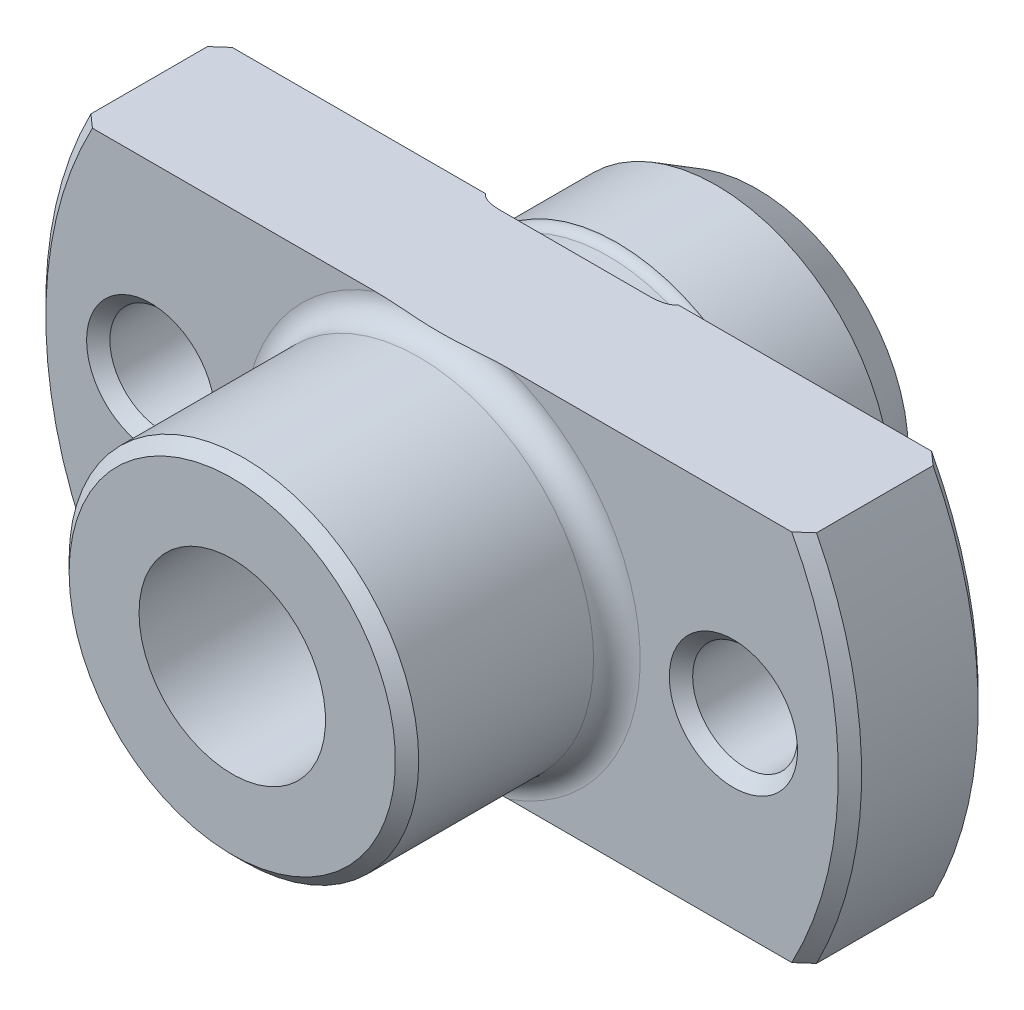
ISO-10303-21;
HEADER;
FILE_DESCRIPTION(('STEP AP214'),'2;1');
FILE_NAME('part.step','',(''),(''),'','','');
FILE_SCHEMA(('AUTOMOTIVE_DESIGN { 1 0 10303 214 1 1 1 1 }'));
ENDSEC;
DATA;
#1=APPLICATION_CONTEXT('core data for automotive mechanical design processes');
#2=APPLICATION_PROTOCOL_DEFINITION('international standard','automotive_design',2000,#1);
#3=PRODUCT_CONTEXT('',#1,'mechanical');
#4=PRODUCT('Part','Part','',(#3));
#5=PRODUCT_RELATED_PRODUCT_CATEGORY('part','',(#4));
#6=PRODUCT_DEFINITION_FORMATION('','',#4);
#7=PRODUCT_DEFINITION_CONTEXT('part definition',#1,'design');
#8=PRODUCT_DEFINITION('design','',#6,#7);
#9=PRODUCT_DEFINITION_SHAPE('','',#8);
#10=(LENGTH_UNIT() NAMED_UNIT(*) SI_UNIT(.MILLI.,.METRE.));
#11=(NAMED_UNIT(*) PLANE_ANGLE_UNIT() SI_UNIT($,.RADIAN.));
#12=(NAMED_UNIT(*) SI_UNIT($,.STERADIAN.) SOLID_ANGLE_UNIT());
#13=UNCERTAINTY_MEASURE_WITH_UNIT(LENGTH_MEASURE(1.E-05),#10,'distance_accuracy_value','');
#14=(GEOMETRIC_REPRESENTATION_CONTEXT(3) GLOBAL_UNCERTAINTY_ASSIGNED_CONTEXT((#13)) GLOBAL_UNIT_ASSIGNED_CONTEXT((#10,
#11,#12)) REPRESENTATION_CONTEXT('',''));
#15=CARTESIAN_POINT('',(0.,0.,0.));
#16=DIRECTION('',(0.,0.,1.));
#17=DIRECTION('',(1.,0.,0.));
#18=AXIS2_PLACEMENT_3D('',#15,#16,#17);
#19=CARTESIAN_POINT('',(7.5,0.,0.));
#20=DIRECTION('',(0.,0.,1.));
#21=DIRECTION('',(1.,0.,0.));
#22=AXIS2_PLACEMENT_3D('',#19,#20,#21);
#23=PLANE('',#22);
#24=CARTESIAN_POINT('',(-12.5,0.,0.));
#25=DIRECTION('',(0.,0.,1.));
#26=DIRECTION('',(1.,0.,0.));
#27=AXIS2_PLACEMENT_3D('',#24,#25,#26);
#28=CIRCLE('',#27,2.75);
#29=CARTESIAN_POINT('',(-9.75,0.,0.));
#30=VERTEX_POINT('',#29);
#31=EDGE_CURVE('E436',#30,#30,#28,.T.);
#32=ORIENTED_EDGE('',*,*,#31,.T.);
#33=EDGE_LOOP('',(#32));
#34=FACE_BOUND('',#33,.T.);
#35=DIRECTION('',(-1.,0.,0.));
#36=VECTOR('',#35,1.);
#37=CARTESIAN_POINT('',(7.5,-8.,0.));
#38=LINE('',#37,#36);
#39=CARTESIAN_POINT('',(-4.12310562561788,-8.,-2.2878555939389E-13));
#40=VERTEX_POINT('',#39);
#41=CARTESIAN_POINT('',(-15.,-8.,0.));
#42=VERTEX_POINT('',#41);
#43=EDGE_CURVE('E314',#40,#42,#38,.T.);
#44=ORIENTED_EDGE('',*,*,#43,.T.);
#45=CARTESIAN_POINT('',(0.,0.,0.));
#46=DIRECTION('',(0.,0.,1.));
#47=DIRECTION('',(1.,0.,0.));
#48=AXIS2_PLACEMENT_3D('',#45,#46,#47);
#49=CIRCLE('',#48,17.);
#50=CARTESIAN_POINT('',(-15.,8.,0.));
#51=VERTEX_POINT('',#50);
#52=EDGE_CURVE('E256',#42,#51,#49,.F.);
#53=ORIENTED_EDGE('',*,*,#52,.T.);
#54=DIRECTION('',(1.,0.,0.));
#55=VECTOR('',#54,1.);
#56=CARTESIAN_POINT('',(7.5,8.,0.));
#57=LINE('',#56,#55);
#58=CARTESIAN_POINT('',(-4.12310562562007,8.,4.68969801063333E-11));
#59=VERTEX_POINT('',#58);
#60=EDGE_CURVE('E395',#51,#59,#57,.T.);
#61=ORIENTED_EDGE('',*,*,#60,.T.);
#62=CARTESIAN_POINT('',(0.,0.,0.));
#63=DIRECTION('',(0.,0.,1.));
#64=DIRECTION('',(1.,0.,0.));
#65=AXIS2_PLACEMENT_3D('',#62,#63,#64);
#66=CIRCLE('',#65,9.);
#67=EDGE_CURVE('E287',#40,#59,#66,.F.);
#68=ORIENTED_EDGE('',*,*,#67,.F.);
#69=EDGE_LOOP('',(#44,#53,#61,#68));
#70=FACE_BOUND('',#69,.T.);
#71=ADVANCED_FACE('F14',(#34,#70),#23,.F.);
#72=CARTESIAN_POINT('',(8.5,0.,6.));
#73=DIRECTION('',(0.,0.,-1.));
#74=DIRECTION('',(-1.,0.,0.));
#75=AXIS2_PLACEMENT_3D('',#72,#73,#74);
#76=PLANE('',#75);
#77=CARTESIAN_POINT('',(12.5,0.,6.));
#78=DIRECTION('',(0.,0.,-1.));
#79=DIRECTION('',(-1.,0.,0.));
#80=AXIS2_PLACEMENT_3D('',#77,#78,#79);
#81=CIRCLE('',#80,2.75000000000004);
#82=CARTESIAN_POINT('',(9.74999999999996,0.,6.));
#83=VERTEX_POINT('',#82);
#84=EDGE_CURVE('E423',#83,#83,#81,.T.);
#85=ORIENTED_EDGE('',*,*,#84,.T.);
#86=EDGE_LOOP('',(#85));
#87=FACE_BOUND('',#86,.T.);
#88=DIRECTION('',(1.,0.,0.));
#89=VECTOR('',#88,1.);
#90=CARTESIAN_POINT('',(8.5,-8.,6.));
#91=LINE('',#90,#89);
#92=CARTESIAN_POINT('',(2.87228132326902,-8.,6.));
#93=VERTEX_POINT('',#92);
#94=CARTESIAN_POINT('',(15.,-8.,6.));
#95=VERTEX_POINT('',#94);
#96=EDGE_CURVE('E307',#93,#95,#91,.T.);
#97=ORIENTED_EDGE('',*,*,#96,.T.);
#98=CARTESIAN_POINT('',(0.,0.,6.));
#99=DIRECTION('',(0.,0.,-1.));
#100=DIRECTION('',(-1.,0.,0.));
#101=AXIS2_PLACEMENT_3D('',#98,#99,#100);
#102=CIRCLE('',#101,17.);
#103=CARTESIAN_POINT('',(15.,8.,6.));
#104=VERTEX_POINT('',#103);
#105=EDGE_CURVE('E529',#95,#104,#102,.F.);
#106=ORIENTED_EDGE('',*,*,#105,.T.);
#107=DIRECTION('',(-1.,0.,0.));
#108=VECTOR('',#107,1.);
#109=CARTESIAN_POINT('',(8.5,8.,6.));
#110=LINE('',#109,#108);
#111=CARTESIAN_POINT('',(2.87228132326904,8.,5.99999999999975));
#112=VERTEX_POINT('',#111);
#113=EDGE_CURVE('E330',#104,#112,#110,.T.);
#114=ORIENTED_EDGE('',*,*,#113,.T.);
#115=CARTESIAN_POINT('',(0.,0.,6.));
#116=DIRECTION('',(0.,0.,-1.));
#117=DIRECTION('',(-1.,0.,0.));
#118=AXIS2_PLACEMENT_3D('',#115,#116,#117);
#119=CIRCLE('',#118,8.5);
#120=EDGE_CURVE('E289',#112,#93,#119,.T.);
#121=ORIENTED_EDGE('',*,*,#120,.T.);
#122=EDGE_LOOP('',(#97,#106,#114,#121));
#123=FACE_BOUND('',#122,.T.);
#124=ADVANCED_FACE('F367',(#87,#123),#76,.F.);
#125=CARTESIAN_POINT('',(0.,0.,-20.2470119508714));
#126=DIRECTION('',(0.,0.,-1.));
#127=DIRECTION('',(-1.,0.,0.));
#128=AXIS2_PLACEMENT_3D('',#125,#126,#127);
#129=CYLINDRICAL_SURFACE('',#128,17.5);
#130=DIRECTION('',(0.,0.,1.));
#131=VECTOR('',#130,1.);
#132=CARTESIAN_POINT('',(-15.5643824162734,8.,-7.5));
#133=LINE('',#132,#131);
#134=CARTESIAN_POINT('',(-15.5643824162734,8.,0.499999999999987));
#135=VERTEX_POINT('',#134);
#136=CARTESIAN_POINT('',(-15.5643824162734,8.,5.5));
#137=VERTEX_POINT('',#136);
#138=EDGE_CURVE('E454',#135,#137,#133,.T.);
#139=ORIENTED_EDGE('',*,*,#138,.F.);
#140=CARTESIAN_POINT('',(0.,0.,0.49999999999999));
#141=DIRECTION('',(0.,0.,1.));
#142=DIRECTION('',(1.,0.,0.));
#143=AXIS2_PLACEMENT_3D('',#140,#141,#142);
#144=CIRCLE('',#143,17.5);
#145=CARTESIAN_POINT('',(-15.5643824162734,-8.,0.499999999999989));
#146=VERTEX_POINT('',#145);
#147=EDGE_CURVE('E261',#135,#146,#144,.T.);
#148=ORIENTED_EDGE('',*,*,#147,.T.);
#149=DIRECTION('',(0.,0.,1.));
#150=VECTOR('',#149,1.);
#151=CARTESIAN_POINT('',(-15.5643824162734,-8.,-7.5));
#152=LINE('',#151,#150);
#153=CARTESIAN_POINT('',(-15.5643824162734,-8.,5.5));
#154=VERTEX_POINT('',#153);
#155=EDGE_CURVE('E326',#146,#154,#152,.T.);
#156=ORIENTED_EDGE('',*,*,#155,.T.);
#157=CARTESIAN_POINT('',(0.,0.,5.5));
#158=DIRECTION('',(0.,0.,-1.));
#159=DIRECTION('',(-1.,0.,0.));
#160=AXIS2_PLACEMENT_3D('',#157,#158,#159);
#161=CIRCLE('',#160,17.5);
#162=EDGE_CURVE('E259',#154,#137,#161,.T.);
#163=ORIENTED_EDGE('',*,*,#162,.T.);
#164=EDGE_LOOP('',(#139,#148,#156,#163));
#165=FACE_BOUND('',#164,.T.);
#166=ADVANCED_FACE('F375',(#165),#129,.T.);
#167=CARTESIAN_POINT('',(0.,0.,-0.1));
#168=DIRECTION('',(0.,0.,1.));
#169=DIRECTION('',(1.,0.,0.));
#170=AXIS2_PLACEMENT_3D('',#167,#168,#169);
#171=TOROIDAL_SURFACE('',#170,8.61270166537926,0.4);
#172=ORIENTED_EDGE('',*,*,#67,.T.);
#173=CARTESIAN_POINT('',(-4.14407784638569,8.,-0.0505008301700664));
#174=CARTESIAN_POINT('',(-4.14046419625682,8.,-0.0371779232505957));
#175=CARTESIAN_POINT('',(-4.13545126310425,8.,-0.0242147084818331));
#176=CARTESIAN_POINT('',(-4.12320975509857,8.,0.000641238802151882));
#177=CARTESIAN_POINT('',(-4.11597087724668,8.,0.0125286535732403));
#178=CARTESIAN_POINT('',(-4.09652172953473,8.,0.0398185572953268));
#179=CARTESIAN_POINT('',(-4.0834949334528,8.,0.0546331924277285));
#180=CARTESIAN_POINT('',(-4.05537793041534,8.,0.0821074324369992));
#181=CARTESIAN_POINT('',(-4.04028438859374,8.,0.0947634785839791));
#182=CARTESIAN_POINT('',(-3.99544778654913,8.,0.128202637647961));
#183=CARTESIAN_POINT('',(-3.96410365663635,8.,0.146815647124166));
#184=CARTESIAN_POINT('',(-3.89920170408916,8.,0.179568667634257));
#185=CARTESIAN_POINT('',(-3.86563808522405,8.,0.193696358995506));
#186=CARTESIAN_POINT('',(-3.79444722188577,8.,0.219559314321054));
#187=CARTESIAN_POINT('',(-3.75671398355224,8.,0.230998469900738));
#188=CARTESIAN_POINT('',(-3.68042031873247,8.,0.250742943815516));
#189=CARTESIAN_POINT('',(-3.64185901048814,8.,0.259044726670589));
#190=CARTESIAN_POINT('',(-3.56418038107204,8.,0.273095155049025));
#191=CARTESIAN_POINT('',(-3.52506188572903,8.,0.278837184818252));
#192=CARTESIAN_POINT('',(-3.44656105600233,8.,0.288135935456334));
#193=CARTESIAN_POINT('',(-3.40717863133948,8.,0.291691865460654));
#194=CARTESIAN_POINT('',(-3.28222243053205,8.,0.299971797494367));
#195=CARTESIAN_POINT('',(-3.19641011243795,8.,0.301211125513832));
#196=CARTESIAN_POINT('',(-3.02491709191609,8.,0.29665209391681));
#197=CARTESIAN_POINT('',(-2.9392367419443,8.,0.290843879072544));
#198=CARTESIAN_POINT('',(-2.76860450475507,8.,0.273003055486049));
#199=CARTESIAN_POINT('',(-2.6836519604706,8.,0.260976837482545));
#200=CARTESIAN_POINT('',(-2.55712901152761,8.,0.238239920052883));
#201=CARTESIAN_POINT('',(-2.51512407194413,8.,0.229882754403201));
#202=CARTESIAN_POINT('',(-2.43149076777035,8.,0.211467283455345));
#203=CARTESIAN_POINT('',(-2.38986233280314,8.,0.201409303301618));
#204=CARTESIAN_POINT('',(-2.3044395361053,8.,0.178611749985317));
#205=CARTESIAN_POINT('',(-2.26068026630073,8.,0.165740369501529));
#206=CARTESIAN_POINT('',(-2.17417208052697,8.,0.137176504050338));
#207=CARTESIAN_POINT('',(-2.13142081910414,8.,0.121491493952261));
#208=CARTESIAN_POINT('',(-2.06987842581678,8.,0.0951735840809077));
#209=CARTESIAN_POINT('',(-2.05036044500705,8.,0.0862490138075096));
#210=CARTESIAN_POINT('',(-2.01199349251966,8.,0.0670770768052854));
#211=CARTESIAN_POINT('',(-1.99314369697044,8.,0.0568314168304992));
#212=CARTESIAN_POINT('',(-1.96037653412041,8.,0.0367392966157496));
#213=CARTESIAN_POINT('',(-1.94624371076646,8.,0.0272463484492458));
#214=CARTESIAN_POINT('',(-1.91930203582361,8.,0.00655241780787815));
#215=CARTESIAN_POINT('',(-1.90648662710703,8.,-0.00463934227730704));
#216=CARTESIAN_POINT('',(-1.89046410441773,8.,-0.0220887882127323));
#217=CARTESIAN_POINT('',(-1.8861064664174,8.,-0.0272765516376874));
#218=CARTESIAN_POINT('',(-1.87801300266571,8.,-0.0381335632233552));
#219=CARTESIAN_POINT('',(-1.87427775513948,8.,-0.0438032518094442));
#220=CARTESIAN_POINT('',(-1.86764207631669,8.,-0.0557330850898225));
#221=CARTESIAN_POINT('',(-1.86475437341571,8.,-0.0620005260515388));
#222=CARTESIAN_POINT('',(-1.86023879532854,8.,-0.0749701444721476));
#223=CARTESIAN_POINT('',(-1.85860676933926,8.,-0.0816708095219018));
#224=CARTESIAN_POINT('',(-1.85696367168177,8.,-0.0945631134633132));
#225=CARTESIAN_POINT('',(-1.85680132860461,8.,-0.100734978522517));
#226=CARTESIAN_POINT('',(-1.85772962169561,8.,-0.112985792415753));
#227=CARTESIAN_POINT('',(-1.85882145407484,8.,-0.119064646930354));
#228=CARTESIAN_POINT('',(-1.8622161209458,8.,-0.131355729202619));
#229=CARTESIAN_POINT('',(-1.86460357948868,8.,-0.137543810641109));
#230=CARTESIAN_POINT('',(-1.87033483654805,8.,-0.149456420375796));
#231=CARTESIAN_POINT('',(-1.87368037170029,8.,-0.155180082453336));
#232=CARTESIAN_POINT('',(-1.88364493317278,8.,-0.17002172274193));
#233=CARTESIAN_POINT('',(-1.89091198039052,8.,-0.178697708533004));
#234=CARTESIAN_POINT('',(-1.90656958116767,8.,-0.19495734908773));
#235=CARTESIAN_POINT('',(-1.9149636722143,8.,-0.202537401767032));
#236=CARTESIAN_POINT('',(-1.93699446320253,8.,-0.220603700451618));
#237=CARTESIAN_POINT('',(-1.95107805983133,8.,-0.230537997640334));
#238=CARTESIAN_POINT('',(-1.98009762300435,8.,-0.249092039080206));
#239=CARTESIAN_POINT('',(-1.99503553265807,8.,-0.257708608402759));
#240=CARTESIAN_POINT('',(-2.02551332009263,8.,-0.274011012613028));
#241=CARTESIAN_POINT('',(-2.04105607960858,8.,-0.281691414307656));
#242=CARTESIAN_POINT('',(-2.07247246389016,8.,-0.296281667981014));
#243=CARTESIAN_POINT('',(-2.08834569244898,8.,-0.303192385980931));
#244=CARTESIAN_POINT('',(-2.13451347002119,8.,-0.322262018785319));
#245=CARTESIAN_POINT('',(-2.16512719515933,8.,-0.333647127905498));
#246=CARTESIAN_POINT('',(-2.22689842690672,8.,-0.354846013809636));
#247=CARTESIAN_POINT('',(-2.25805622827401,8.,-0.364658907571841));
#248=CARTESIAN_POINT('',(-2.35220089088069,8.,-0.392250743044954));
#249=CARTESIAN_POINT('',(-2.41574355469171,8.,-0.40813871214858));
#250=CARTESIAN_POINT('',(-2.54372887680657,8.,-0.436028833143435));
#251=CARTESIAN_POINT('',(-2.60817254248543,8.,-0.448026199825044));
#252=CARTESIAN_POINT('',(-2.73755116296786,8.,-0.468398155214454));
#253=CARTESIAN_POINT('',(-2.8024854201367,8.,-0.476777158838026));
#254=CARTESIAN_POINT('',(-2.93248749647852,8.,-0.489853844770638));
#255=CARTESIAN_POINT('',(-2.99755397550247,8.,-0.49456477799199));
#256=CARTESIAN_POINT('',(-3.12791921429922,8.,-0.50001864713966));
#257=CARTESIAN_POINT('',(-3.19321812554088,8.,-0.500758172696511));
#258=CARTESIAN_POINT('',(-3.32349856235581,8.,-0.497626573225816));
#259=CARTESIAN_POINT('',(-3.38848040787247,8.,-0.493771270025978));
#260=CARTESIAN_POINT('',(-3.51781010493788,8.,-0.480437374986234));
#261=CARTESIAN_POINT('',(-3.58215876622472,8.,-0.470967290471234));
#262=CARTESIAN_POINT('',(-3.69495673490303,8.,-0.447585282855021));
#263=CARTESIAN_POINT('',(-3.74369923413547,8.,-0.435169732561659));
#264=CARTESIAN_POINT('',(-3.81530597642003,8.,-0.41211827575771));
#265=CARTESIAN_POINT('',(-3.83888677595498,8.,-0.403713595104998));
#266=CARTESIAN_POINT('',(-3.88533786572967,8.,-0.385144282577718));
#267=CARTESIAN_POINT('',(-3.90820871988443,8.,-0.374981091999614));
#268=CARTESIAN_POINT('',(-3.94897439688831,8.,-0.354483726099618));
#269=CARTESIAN_POINT('',(-3.9670393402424,8.,-0.344491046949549));
#270=CARTESIAN_POINT('',(-4.00214794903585,8.,-0.322738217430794));
#271=CARTESIAN_POINT('',(-4.01918933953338,8.,-0.31097431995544));
#272=CARTESIAN_POINT('',(-4.05185729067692,8.,-0.285180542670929));
#273=CARTESIAN_POINT('',(-4.06746257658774,8.,-0.271123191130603));
#274=CARTESIAN_POINT('',(-4.09595719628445,8.,-0.240482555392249));
#275=CARTESIAN_POINT('',(-4.10885910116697,8.,-0.223911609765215));
#276=CARTESIAN_POINT('',(-4.12553224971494,8.,-0.196144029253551));
#277=CARTESIAN_POINT('',(-4.13080743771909,8.,-0.185854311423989));
#278=CARTESIAN_POINT('',(-4.13968065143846,8.,-0.164565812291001));
#279=CARTESIAN_POINT('',(-4.14327977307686,8.,-0.153567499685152));
#280=CARTESIAN_POINT('',(-4.148498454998,8.,-0.131001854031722));
#281=CARTESIAN_POINT('',(-4.15010075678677,8.,-0.119430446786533));
#282=CARTESIAN_POINT('',(-4.15108343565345,8.,-0.0962014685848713));
#283=CARTESIAN_POINT('',(-4.15046748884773,8.,-0.0845440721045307));
#284=CARTESIAN_POINT('',(-4.14822859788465,8.,-0.0692579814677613));
#285=CARTESIAN_POINT('',(-4.14755402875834,8.,-0.065471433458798));
#286=CARTESIAN_POINT('',(-4.14598163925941,8.,-0.057947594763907));
#287=CARTESIAN_POINT('',(-4.14508397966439,8.,-0.0542102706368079));
#288=CARTESIAN_POINT('',(-4.14407784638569,8.,-0.0505008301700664));
#289=B_SPLINE_CURVE_WITH_KNOTS('',3,(#173,#174,#175,#176,#177,#178,#179,#180,#181,#182,#183,
#184,#185,#186,#187,#188,#189,#190,#191,#192,#193,#194,#195,#196,#197,#198,#199,#200,#201,#202,
#203,#204,#205,#206,#207,#208,#209,#210,#211,#212,#213,#214,#215,#216,#217,#218,#219,#220,#221,
#222,#223,#224,#225,#226,#227,#228,#229,#230,#231,#232,#233,#234,#235,#236,#237,#238,#239,#240,
#241,#242,#243,#244,#245,#246,#247,#248,#249,#250,#251,#252,#253,#254,#255,#256,#257,#258,#259,
#260,#261,#262,#263,#264,#265,#266,#267,#268,#269,#270,#271,#272,#273,#274,#275,#276,#277,#278,
#279,#280,#281,#282,#283,#284,#285,#286,#287,#288),.UNSPECIFIED.,.T.,.F.,(4,2,2,2,2,2,2,2,2,2,2,
2,2,2,2,2,2,2,2,2,2,2,2,2,2,2,2,2,2,2,2,2,2,2,2,2,2,2,2,2,2,2,2,2,2,2,2,2,2,2,2,2,2,2,2,2,2,4),
(0.,0.0413954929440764,0.0829855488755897,0.141830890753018,0.200772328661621,0.309522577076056,
0.418568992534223,0.53667112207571,0.654905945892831,0.773444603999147,0.8920261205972,
1.14907591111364,1.40648557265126,1.66363119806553,1.79209030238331,1.92052487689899,
2.05730758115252,2.19373214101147,2.25808764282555,2.32236081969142,2.3733775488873,
2.42412662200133,2.44441828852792,2.46472870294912,2.48533013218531,2.50586316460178,
2.52425524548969,2.54266488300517,2.56245419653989,2.58227961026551,2.61604020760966,
2.64990936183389,2.70148212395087,2.75317725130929,2.80515939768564,2.85708245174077,
2.95500058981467,3.05297353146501,3.24928902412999,3.44584506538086,3.64216059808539,
3.83776360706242,4.03353455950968,4.2286333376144,4.42343726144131,4.57401865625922,
4.64906685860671,4.72405383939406,4.78591154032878,4.84790199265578,4.91069838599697,
4.97319594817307,5.00776895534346,5.0423193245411,5.07716628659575,5.11195552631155,
5.12348938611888,5.13501495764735),.UNSPECIFIED.);
#290=CARTESIAN_POINT('',(-3.19039652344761,8.,0.3));
#291=VERTEX_POINT('',#290);
#292=EDGE_CURVE('E126',#59,#291,#289,.T.);
#293=ORIENTED_EDGE('',*,*,#292,.T.);
#294=CARTESIAN_POINT('',(0.,0.,0.3));
#295=DIRECTION('',(0.,0.,-1.));
#296=DIRECTION('',(-1.,0.,0.));
#297=AXIS2_PLACEMENT_3D('',#294,#295,#296);
#298=CIRCLE('',#297,8.61270166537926);
#299=CARTESIAN_POINT('',(-3.19039652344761,-8.,0.3));
#300=VERTEX_POINT('',#299);
#301=EDGE_CURVE('E137',#300,#291,#298,.T.);
#302=ORIENTED_EDGE('',*,*,#301,.F.);
#303=CARTESIAN_POINT('',(-4.14407784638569,-8.,-0.0505008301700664));
#304=CARTESIAN_POINT('',(-4.14684210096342,-8.,-0.0606992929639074));
#305=CARTESIAN_POINT('',(-4.14879335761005,-8.,-0.0711245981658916));
#306=CARTESIAN_POINT('',(-4.15089156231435,-8.,-0.092155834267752));
#307=CARTESIAN_POINT('',(-4.15103893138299,-8.,-0.102761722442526));
#308=CARTESIAN_POINT('',(-4.14951695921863,-8.,-0.12383024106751));
#309=CARTESIAN_POINT('',(-4.14784926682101,-8.,-0.134292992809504));
#310=CARTESIAN_POINT('',(-4.14285267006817,-8.,-0.154811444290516));
#311=CARTESIAN_POINT('',(-4.13952255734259,-8.,-0.164866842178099));
#312=CARTESIAN_POINT('',(-4.13002467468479,-8.,-0.187832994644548));
#313=CARTESIAN_POINT('',(-4.12327030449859,-8.,-0.200499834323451));
#314=CARTESIAN_POINT('',(-4.1078326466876,-8.,-0.224593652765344));
#315=CARTESIAN_POINT('',(-4.09914504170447,-8.,-0.236017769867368));
#316=CARTESIAN_POINT('',(-4.07470005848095,-8.,-0.26421777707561));
#317=CARTESIAN_POINT('',(-4.05785031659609,-8.,-0.28003777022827));
#318=CARTESIAN_POINT('',(-4.02203812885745,-8.,-0.309044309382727));
#319=CARTESIAN_POINT('',(-4.00307026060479,-8.,-0.322223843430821));
#320=CARTESIAN_POINT('',(-3.96426305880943,-8.,-0.346152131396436));
#321=CARTESIAN_POINT('',(-3.9444527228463,-8.,-0.356948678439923));
#322=CARTESIAN_POINT('',(-3.90398770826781,-8.,-0.376840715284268));
#323=CARTESIAN_POINT('',(-3.88333223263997,-8.,-0.385934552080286));
#324=CARTESIAN_POINT('',(-3.82046318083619,-8.,-0.411101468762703));
#325=CARTESIAN_POINT('',(-3.77739488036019,-8.,-0.425032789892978));
#326=CARTESIAN_POINT('',(-3.6852513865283,-8.,-0.449982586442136));
#327=CARTESIAN_POINT('',(-3.63604678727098,-8.,-0.460494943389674));
#328=CARTESIAN_POINT('',(-3.53690717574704,-8.,-0.477468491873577));
#329=CARTESIAN_POINT('',(-3.48697137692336,-8.,-0.483924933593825));
#330=CARTESIAN_POINT('',(-3.38667276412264,-8.,-0.493529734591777));
#331=CARTESIAN_POINT('',(-3.33630920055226,-8.,-0.496669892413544));
#332=CARTESIAN_POINT('',(-3.2354702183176,-8.,-0.500114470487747));
#333=CARTESIAN_POINT('',(-3.18499475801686,-8.,-0.500417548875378));
#334=CARTESIAN_POINT('',(-3.06279342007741,-8.,-0.498128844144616));
#335=CARTESIAN_POINT('',(-2.99109108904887,-8.,-0.494261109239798));
#336=CARTESIAN_POINT('',(-2.84808884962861,-8.,-0.482060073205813));
#337=CARTESIAN_POINT('',(-2.77678888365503,-8.,-0.473727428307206));
#338=CARTESIAN_POINT('',(-2.63502742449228,-8.,-0.452781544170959));
#339=CARTESIAN_POINT('',(-2.5645641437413,-8.,-0.440180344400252));
#340=CARTESIAN_POINT('',(-2.4246444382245,-8.,-0.410396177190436));
#341=CARTESIAN_POINT('',(-2.35518711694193,-8.,-0.393217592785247));
#342=CARTESIAN_POINT('',(-2.25075735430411,-8.,-0.362469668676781));
#343=CARTESIAN_POINT('',(-2.21513920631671,-8.,-0.351087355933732));
#344=CARTESIAN_POINT('',(-2.14463018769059,-8.,-0.326166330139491));
#345=CARTESIAN_POINT('',(-2.10973936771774,-8.,-0.312627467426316));
#346=CARTESIAN_POINT('',(-2.05083685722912,-8.,-0.286564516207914));
#347=CARTESIAN_POINT('',(-2.02648948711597,-8.,-0.274798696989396));
#348=CARTESIAN_POINT('',(-1.97903104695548,-8.,-0.248777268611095));
#349=CARTESIAN_POINT('',(-1.95592058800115,-8.,-0.234520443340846));
#350=CARTESIAN_POINT('',(-1.92352648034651,-8.,-0.209868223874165));
#351=CARTESIAN_POINT('',(-1.91305960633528,-8.,-0.201052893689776));
#352=CARTESIAN_POINT('',(-1.89362948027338,-8.,-0.18191231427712));
#353=CARTESIAN_POINT('',(-1.88465609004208,-8.,-0.171598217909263));
#354=CARTESIAN_POINT('',(-1.87384138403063,-8.,-0.155387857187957));
#355=CARTESIAN_POINT('',(-1.87083215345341,-8.,-0.150281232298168));
#356=CARTESIAN_POINT('',(-1.86556022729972,-8.,-0.139689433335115));
#357=CARTESIAN_POINT('',(-1.86329718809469,-8.,-0.134204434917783));
#358=CARTESIAN_POINT('',(-1.85971315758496,-8.,-0.122852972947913));
#359=CARTESIAN_POINT('',(-1.85840369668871,-8.,-0.116982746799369));
#360=CARTESIAN_POINT('',(-1.85695492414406,-8.,-0.105100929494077));
#361=CARTESIAN_POINT('',(-1.85681411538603,-8.,-0.0990895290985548));
#362=CARTESIAN_POINT('',(-1.85766627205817,-8.,-0.0878562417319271));
#363=CARTESIAN_POINT('',(-1.85852937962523,-8.,-0.0826237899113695));
#364=CARTESIAN_POINT('',(-1.86108177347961,-8.,-0.0723647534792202));
#365=CARTESIAN_POINT('',(-1.86277191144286,-8.,-0.0673383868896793));
#366=CARTESIAN_POINT('',(-1.86778452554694,-8.,-0.055266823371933));
#367=CARTESIAN_POINT('',(-1.87150090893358,-8.,-0.0483870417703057));
#368=CARTESIAN_POINT('',(-1.87993955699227,-8.,-0.0352778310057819));
#369=CARTESIAN_POINT('',(-1.88466465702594,-8.,-0.0290503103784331));
#370=CARTESIAN_POINT('',(-1.89945392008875,-8.,-0.0116814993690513));
#371=CARTESIAN_POINT('',(-1.91041671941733,-8.,-0.00131772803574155));
#372=CARTESIAN_POINT('',(-1.93357172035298,-8.,0.0179057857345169));
#373=CARTESIAN_POINT('',(-1.94576787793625,-8.,0.0267604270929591));
#374=CARTESIAN_POINT('',(-1.98026756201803,-8.,0.0496382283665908));
#375=CARTESIAN_POINT('',(-2.00329390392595,-8.,0.0625596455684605));
#376=CARTESIAN_POINT('',(-2.05037779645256,-8.,0.0863970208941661));
#377=CARTESIAN_POINT('',(-2.07443785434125,-8.,0.0973077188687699));
#378=CARTESIAN_POINT('',(-2.12330374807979,-8.,0.117744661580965));
#379=CARTESIAN_POINT('',(-2.14811315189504,-8.,0.12726234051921));
#380=CARTESIAN_POINT('',(-2.19809584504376,-8.,0.145164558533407));
#381=CARTESIAN_POINT('',(-2.22326865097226,-8.,0.153550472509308));
#382=CARTESIAN_POINT('',(-2.29090257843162,-8.,0.174740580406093));
#383=CARTESIAN_POINT('',(-2.33361951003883,-8.,0.18672927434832));
#384=CARTESIAN_POINT('',(-2.41957341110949,-8.,0.208687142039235));
#385=CARTESIAN_POINT('',(-2.46281057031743,-8.,0.218655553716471));
#386=CARTESIAN_POINT('',(-2.59323404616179,-8.,0.24595070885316));
#387=CARTESIAN_POINT('',(-2.68098639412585,-8.,0.260624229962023));
#388=CARTESIAN_POINT('',(-2.85687855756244,-8.,0.283342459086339));
#389=CARTESIAN_POINT('',(-2.94501424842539,-8.,0.291419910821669));
#390=CARTESIAN_POINT('',(-3.12155154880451,-8.,0.300428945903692));
#391=CARTESIAN_POINT('',(-3.2099524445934,-8.,0.301372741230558));
#392=CARTESIAN_POINT('',(-3.34788144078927,-8.,0.296012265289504));
#393=CARTESIAN_POINT('',(-3.39752599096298,-8.,0.292693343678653));
#394=CARTESIAN_POINT('',(-3.4965872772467,-8.,0.282754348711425));
#395=CARTESIAN_POINT('',(-3.5460033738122,-8.,0.276127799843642));
#396=CARTESIAN_POINT('',(-3.65244729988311,-8.,0.257387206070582));
#397=CARTESIAN_POINT('',(-3.70935842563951,-8.,0.244538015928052));
#398=CARTESIAN_POINT('',(-3.79295245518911,-8.,0.219662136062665));
#399=CARTESIAN_POINT('',(-3.82047495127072,-8.,0.210457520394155));
#400=CARTESIAN_POINT('',(-3.87464136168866,-8.,0.189774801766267));
#401=CARTESIAN_POINT('',(-3.90128626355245,-8.,0.17829936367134));
#402=CARTESIAN_POINT('',(-3.94650267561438,-8.,0.15582994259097));
#403=CARTESIAN_POINT('',(-3.965387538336,-8.,0.145471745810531));
#404=CARTESIAN_POINT('',(-4.00206482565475,-8.,0.122830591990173));
#405=CARTESIAN_POINT('',(-4.01985410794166,-8.,0.110542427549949));
#406=CARTESIAN_POINT('',(-4.05390925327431,-8.,0.0834577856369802));
#407=CARTESIAN_POINT('',(-4.07014665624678,-8.,0.068624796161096));
#408=CARTESIAN_POINT('',(-4.09952120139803,-8.,0.0361772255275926));
#409=CARTESIAN_POINT('',(-4.11267896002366,-8.,0.0185825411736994));
#410=CARTESIAN_POINT('',(-4.12776818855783,-8.,-0.00830838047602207));
#411=CARTESIAN_POINT('',(-4.13176839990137,-8.,-0.016450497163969));
#412=CARTESIAN_POINT('',(-4.13873787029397,-8.,-0.0331729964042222));
#413=CARTESIAN_POINT('',(-4.14170690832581,-8.,-0.0417534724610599));
#414=CARTESIAN_POINT('',(-4.14407784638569,-8.,-0.0505008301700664));
#415=B_SPLINE_CURVE_WITH_KNOTS('',3,(#303,#304,#305,#306,#307,#308,#309,#310,#311,#312,#313,
#314,#315,#316,#317,#318,#319,#320,#321,#322,#323,#324,#325,#326,#327,#328,#329,#330,#331,#332,
#333,#334,#335,#336,#337,#338,#339,#340,#341,#342,#343,#344,#345,#346,#347,#348,#349,#350,#351,
#352,#353,#354,#355,#356,#357,#358,#359,#360,#361,#362,#363,#364,#365,#366,#367,#368,#369,#370,
#371,#372,#373,#374,#375,#376,#377,#378,#379,#380,#381,#382,#383,#384,#385,#386,#387,#388,#389,
#390,#391,#392,#393,#394,#395,#396,#397,#398,#399,#400,#401,#402,#403,#404,#405,#406,#407,#408,
#409,#410,#411,#412,#413,#414),.UNSPECIFIED.,.T.,.F.,(4,2,2,2,2,2,2,2,2,2,2,2,2,2,2,2,2,2,2,2,2,
2,2,2,2,2,2,2,2,2,2,2,2,2,2,2,2,2,2,2,2,2,2,2,2,2,2,2,2,2,2,2,2,2,2,4),(0.,0.0316697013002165,
0.0633320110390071,0.0949655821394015,0.126622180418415,0.169445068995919,0.21236456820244,
0.281312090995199,0.350440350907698,0.418021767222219,0.485668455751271,0.621125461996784,
0.771868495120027,0.922787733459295,1.07407934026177,1.22544250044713,1.4406975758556,
1.65592102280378,1.8705424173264,2.0849590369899,2.19709875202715,2.30924625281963,
2.39031958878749,2.47143261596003,2.5124089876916,2.55309472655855,2.57083131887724,
2.58855973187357,2.60649910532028,2.62441549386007,2.64024976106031,2.65610036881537,
2.6794237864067,2.70281364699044,2.74781905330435,2.79297369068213,2.87197980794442,
2.95118976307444,3.03086798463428,3.11044852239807,3.24347975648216,3.37656107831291,
3.64317893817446,3.9084650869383,4.17329699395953,4.32247238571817,4.47194097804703,
4.64653283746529,4.73352408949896,4.82041385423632,4.88494763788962,4.94965863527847,
5.01539048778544,5.08066884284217,5.10782655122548,5.13499007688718),.UNSPECIFIED.);
#416=EDGE_CURVE('E127',#300,#40,#415,.T.);
#417=ORIENTED_EDGE('',*,*,#416,.T.);
#418=EDGE_LOOP('',(#172,#293,#302,#417));
#419=FACE_BOUND('',#418,.T.);
#420=ADVANCED_FACE('F380',(#419),#171,.F.);
#421=CARTESIAN_POINT('',(12.5,0.,0.));
#422=DIRECTION('',(0.,0.,1.));
#423=DIRECTION('',(1.,0.,0.));
#424=AXIS2_PLACEMENT_3D('',#421,#422,#423);
#425=CIRCLE('',#424,2.75);
#426=CARTESIAN_POINT('',(15.25,0.,0.));
#427=VERTEX_POINT('',#426);
#428=EDGE_CURVE('E392',#427,#427,#425,.T.);
#429=ORIENTED_EDGE('',*,*,#428,.T.);
#430=EDGE_LOOP('',(#429));
#431=FACE_BOUND('',#430,.T.);
#432=CARTESIAN_POINT('',(4.1231056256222,7.99999999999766,0.));
#433=VERTEX_POINT('',#432);
#434=CARTESIAN_POINT('',(15.,8.,0.));
#435=VERTEX_POINT('',#434);
#436=EDGE_CURVE('E121',#433,#435,#57,.T.);
#437=ORIENTED_EDGE('',*,*,#436,.T.);
#438=CARTESIAN_POINT('',(0.,0.,0.));
#439=DIRECTION('',(0.,0.,1.));
#440=DIRECTION('',(1.,0.,0.));
#441=AXIS2_PLACEMENT_3D('',#438,#439,#440);
#442=CIRCLE('',#441,17.);
#443=CARTESIAN_POINT('',(15.,-8.,0.));
#444=VERTEX_POINT('',#443);
#445=EDGE_CURVE('E253',#435,#444,#442,.F.);
#446=ORIENTED_EDGE('',*,*,#445,.T.);
#447=CARTESIAN_POINT('',(4.12310562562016,-8.,-4.43338928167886E-12));
#448=VERTEX_POINT('',#447);
#449=EDGE_CURVE('E319',#444,#448,#38,.T.);
#450=ORIENTED_EDGE('',*,*,#449,.T.);
#451=EDGE_CURVE('E292',#433,#448,#66,.F.);
#452=ORIENTED_EDGE('',*,*,#451,.F.);
#453=EDGE_LOOP('',(#437,#446,#450,#452));
#454=FACE_BOUND('',#453,.T.);
#455=ADVANCED_FACE('F370',(#431,#454),#23,.F.);
#456=CARTESIAN_POINT('',(0.,0.,-20.2470119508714));
#457=DIRECTION('',(0.,0.,-1.));
#458=DIRECTION('',(-1.,0.,0.));
#459=AXIS2_PLACEMENT_3D('',#456,#457,#458);
#460=CYLINDRICAL_SURFACE('',#459,7.5);
#461=CARTESIAN_POINT('',(0.,0.,-5.76794919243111));
#462=DIRECTION('',(0.,0.,1.));
#463=DIRECTION('',(1.,0.,0.));
#464=AXIS2_PLACEMENT_3D('',#461,#462,#463);
#465=CIRCLE('',#464,7.5);
#466=CARTESIAN_POINT('',(7.5,0.,-5.76794919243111));
#467=VERTEX_POINT('',#466);
#468=EDGE_CURVE('E417',#467,#467,#465,.T.);
#469=ORIENTED_EDGE('',*,*,#468,.T.);
#470=EDGE_LOOP('',(#469));
#471=FACE_BOUND('',#470,.T.);
#472=CARTESIAN_POINT('',(0.,0.,-1.5));
#473=DIRECTION('',(0.,0.,1.));
#474=DIRECTION('',(1.,0.,0.));
#475=AXIS2_PLACEMENT_3D('',#472,#473,#474);
#476=CIRCLE('',#475,7.5);
#477=CARTESIAN_POINT('',(7.5,0.,-1.5));
#478=VERTEX_POINT('',#477);
#479=EDGE_CURVE('E302',#478,#478,#476,.T.);
#480=ORIENTED_EDGE('',*,*,#479,.F.);
#481=EDGE_LOOP('',(#480));
#482=FACE_BOUND('',#481,.T.);
#483=ADVANCED_FACE('F281',(#471,#482),#460,.T.);
#484=CARTESIAN_POINT('',(2.7,0.,-6.5));
#485=DIRECTION('',(0.,0.,-1.));
#486=DIRECTION('',(-1.,0.,0.));
#487=AXIS2_PLACEMENT_3D('',#484,#485,#486);
#488=PLANE('',#487);
#489=CARTESIAN_POINT('',(0.,0.,-6.5));
#490=DIRECTION('',(0.,0.,-1.));
#491=DIRECTION('',(-1.,0.,0.));
#492=AXIS2_PLACEMENT_3D('',#489,#490,#491);
#493=CIRCLE('',#492,4.1);
#494=CARTESIAN_POINT('',(-4.1,0.,-6.5));
#495=VERTEX_POINT('',#494);
#496=EDGE_CURVE('E265',#495,#495,#493,.F.);
#497=ORIENTED_EDGE('',*,*,#496,.T.);
#498=EDGE_LOOP('',(#497));
#499=FACE_BOUND('',#498,.T.);
#500=CARTESIAN_POINT('',(0.,0.,-6.5));
#501=DIRECTION('',(0.,0.,-1.));
#502=DIRECTION('',(-1.,0.,0.));
#503=AXIS2_PLACEMENT_3D('',#500,#501,#502);
#504=CIRCLE('',#503,2.7);
#505=CARTESIAN_POINT('',(-2.7,0.,-6.5));
#506=VERTEX_POINT('',#505);
#507=EDGE_CURVE('E284',#506,#506,#504,.T.);
#508=ORIENTED_EDGE('',*,*,#507,.T.);
#509=EDGE_LOOP('',(#508));
#510=FACE_BOUND('',#509,.T.);
#511=ADVANCED_FACE('F277',(#499,#510),#488,.F.);
#512=CARTESIAN_POINT('',(0.,0.,-20.2470119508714));
#513=DIRECTION('',(0.,0.,-1.));
#514=DIRECTION('',(-1.,0.,0.));
#515=AXIS2_PLACEMENT_3D('',#512,#513,#514);
#516=CYLINDRICAL_SURFACE('',#515,4.);
#517=CARTESIAN_POINT('',(0.,0.,0.));
#518=DIRECTION('',(0.,0.,1.));
#519=DIRECTION('',(1.,0.,0.));
#520=AXIS2_PLACEMENT_3D('',#517,#518,#519);
#521=CIRCLE('',#520,4.);
#522=CARTESIAN_POINT('',(4.,0.,0.));
#523=VERTEX_POINT('',#522);
#524=EDGE_CURVE('E456',#523,#523,#521,.T.);
#525=ORIENTED_EDGE('',*,*,#524,.F.);
#526=EDGE_LOOP('',(#525));
#527=FACE_BOUND('',#526,.T.);
#528=CARTESIAN_POINT('',(0.,0.,15.));
#529=DIRECTION('',(0.,0.,-1.));
#530=DIRECTION('',(-1.,0.,0.));
#531=AXIS2_PLACEMENT_3D('',#528,#529,#530);
#532=CIRCLE('',#531,4.);
#533=CARTESIAN_POINT('',(-4.,0.,15.));
#534=VERTEX_POINT('',#533);
#535=EDGE_CURVE('E148',#534,#534,#532,.T.);
#536=ORIENTED_EDGE('',*,*,#535,.F.);
#537=EDGE_LOOP('',(#536));
#538=FACE_BOUND('',#537,.T.);
#539=ADVANCED_FACE('F280',(#527,#538),#516,.F.);
#540=CARTESIAN_POINT('',(4.,0.,15.));
#541=DIRECTION('',(0.,0.,-1.));
#542=DIRECTION('',(-1.,0.,0.));
#543=AXIS2_PLACEMENT_3D('',#540,#541,#542);
#544=PLANE('',#543);
#545=CARTESIAN_POINT('',(0.,0.,15.));
#546=DIRECTION('',(0.,0.,-1.));
#547=DIRECTION('',(-1.,0.,0.));
#548=AXIS2_PLACEMENT_3D('',#545,#546,#547);
#549=CIRCLE('',#548,7.);
#550=CARTESIAN_POINT('',(-7.,0.,15.));
#551=VERTEX_POINT('',#550);
#552=EDGE_CURVE('E409',#551,#551,#549,.F.);
#553=ORIENTED_EDGE('',*,*,#552,.T.);
#554=EDGE_LOOP('',(#553));
#555=FACE_BOUND('',#554,.T.);
#556=ORIENTED_EDGE('',*,*,#535,.T.);
#557=EDGE_LOOP('',(#556));
#558=FACE_BOUND('',#557,.T.);
#559=ADVANCED_FACE('F353',(#555,#558),#544,.F.);
#560=CARTESIAN_POINT('',(0.,0.,-20.2470119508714));
#561=DIRECTION('',(0.,0.,-1.));
#562=DIRECTION('',(-1.,0.,0.));
#563=AXIS2_PLACEMENT_3D('',#560,#561,#562);
#564=CYLINDRICAL_SURFACE('',#563,7.5);
#565=CARTESIAN_POINT('',(0.,0.,14.5));
#566=DIRECTION('',(0.,0.,-1.));
#567=DIRECTION('',(-1.,0.,0.));
#568=AXIS2_PLACEMENT_3D('',#565,#566,#567);
#569=CIRCLE('',#568,7.5);
#570=CARTESIAN_POINT('',(-7.5,0.,14.5));
#571=VERTEX_POINT('',#570);
#572=EDGE_CURVE('E414',#571,#571,#569,.T.);
#573=ORIENTED_EDGE('',*,*,#572,.T.);
#574=EDGE_LOOP('',(#573));
#575=FACE_BOUND('',#574,.T.);
#576=CARTESIAN_POINT('',(0.,0.,7.));
#577=DIRECTION('',(0.,0.,-1.));
#578=DIRECTION('',(-1.,0.,0.));
#579=AXIS2_PLACEMENT_3D('',#576,#577,#578);
#580=CIRCLE('',#579,7.5);
#581=CARTESIAN_POINT('',(-7.5,0.,7.));
#582=VERTEX_POINT('',#581);
#583=EDGE_CURVE('E297',#582,#582,#580,.T.);
#584=ORIENTED_EDGE('',*,*,#583,.F.);
#585=EDGE_LOOP('',(#584));
#586=FACE_BOUND('',#585,.T.);
#587=ADVANCED_FACE('F347',(#575,#586),#564,.T.);
#588=CARTESIAN_POINT('',(0.,0.,7.));
#589=DIRECTION('',(0.,0.,-1.));
#590=DIRECTION('',(-1.,0.,0.));
#591=AXIS2_PLACEMENT_3D('',#588,#589,#590);
#592=TOROIDAL_SURFACE('',#591,8.5,1.);
#593=ORIENTED_EDGE('',*,*,#120,.F.);
#594=CARTESIAN_POINT('',(0.,8.,6.13397459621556));
#595=CARTESIAN_POINT('',(-0.166302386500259,8.,6.13396927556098));
#596=CARTESIAN_POINT('',(-0.332606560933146,8.,6.13091213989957));
#597=CARTESIAN_POINT('',(-0.66512019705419,8.,6.11946219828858));
#598=CARTESIAN_POINT('',(-0.831329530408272,8.,6.11106598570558));
#599=CARTESIAN_POINT('',(-1.16464241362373,8.,6.09097612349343));
#600=CARTESIAN_POINT('',(-1.33174454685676,8.,6.07926088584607));
#601=CARTESIAN_POINT('',(-1.66586475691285,8.,6.05546035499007));
#602=CARTESIAN_POINT('',(-1.83288284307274,8.,6.04337518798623));
#603=CARTESIAN_POINT('',(-2.16844804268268,8.,6.02202077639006));
#604=CARTESIAN_POINT('',(-2.33699674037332,8.,6.01277472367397));
#605=CARTESIAN_POINT('',(-2.67457162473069,8.,6.00090156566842));
#606=CARTESIAN_POINT('',(-2.84359812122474,8.,5.99828113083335));
#607=CARTESIAN_POINT('',(-3.09624211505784,8.,6.00260530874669));
#608=CARTESIAN_POINT('',(-3.1799240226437,8.,6.00539100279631));
#609=CARTESIAN_POINT('',(-3.34710234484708,8.,6.01432102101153));
#610=CARTESIAN_POINT('',(-3.43059879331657,8.,6.02046467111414));
#611=CARTESIAN_POINT('',(-3.59703901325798,8.,6.03684470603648));
#612=CARTESIAN_POINT('',(-3.67998353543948,8.,6.04707325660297));
#613=CARTESIAN_POINT('',(-3.84508644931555,8.,6.07252905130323));
#614=CARTESIAN_POINT('',(-3.92724526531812,8.,6.08775341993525));
#615=CARTESIAN_POINT('',(-4.0487226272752,8.,6.11503949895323));
#616=CARTESIAN_POINT('',(-4.08856723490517,8.,6.12476851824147));
#617=CARTESIAN_POINT('',(-4.16781719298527,8.,6.14588114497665));
#618=CARTESIAN_POINT('',(-4.2072225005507,8.,6.15726491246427));
#619=CARTESIAN_POINT('',(-4.32484824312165,8.,6.19425796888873));
#620=CARTESIAN_POINT('',(-4.40223602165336,8.,6.22265711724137));
#621=CARTESIAN_POINT('',(-4.55395249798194,8.,6.28912822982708));
#622=CARTESIAN_POINT('',(-4.62823188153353,8.,6.32731483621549));
#623=CARTESIAN_POINT('',(-4.7692161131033,8.,6.41571932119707));
#624=CARTESIAN_POINT('',(-4.83596054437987,8.,6.46586955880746));
#625=CARTESIAN_POINT('',(-4.92368939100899,8.,6.5503517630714));
#626=CARTESIAN_POINT('',(-4.95016642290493,8.,6.57896276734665));
#627=CARTESIAN_POINT('',(-4.99892755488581,8.,6.63962650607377));
#628=CARTESIAN_POINT('',(-5.02121140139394,8.,6.67167944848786));
#629=CARTESIAN_POINT('',(-5.06042702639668,8.,6.7394966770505));
#630=CARTESIAN_POINT('',(-5.0772905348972,8.,6.77530130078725));
#631=CARTESIAN_POINT('',(-5.10367656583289,8.,6.84952233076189));
#632=CARTESIAN_POINT('',(-5.11321295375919,8.,6.88793365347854));
#633=CARTESIAN_POINT('',(-5.12314752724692,8.,6.96097403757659));
#634=CARTESIAN_POINT('',(-5.12454942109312,8.,6.9954665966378));
#635=CARTESIAN_POINT('',(-5.12075689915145,8.,7.0640859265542));
#636=CARTESIAN_POINT('',(-5.11556252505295,8.,7.09821269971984));
#637=CARTESIAN_POINT('',(-5.10000612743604,8.,7.16131052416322));
#638=CARTESIAN_POINT('',(-5.09026510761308,8.,7.19043952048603));
#639=CARTESIAN_POINT('',(-5.06663824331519,8.,7.24694416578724));
#640=CARTESIAN_POINT('',(-5.05275132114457,8.,7.27431935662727));
#641=CARTESIAN_POINT('',(-5.01348396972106,8.,7.3406830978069));
#642=CARTESIAN_POINT('',(-4.98587447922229,8.,7.37835133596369));
#643=CARTESIAN_POINT('',(-4.92506400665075,8.,7.44886213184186));
#644=CARTESIAN_POINT('',(-4.89184863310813,8.,7.48169185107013));
#645=CARTESIAN_POINT('',(-4.80011212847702,8.,7.5615136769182));
#646=CARTESIAN_POINT('',(-4.73850948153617,8.,7.60493646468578));
#647=CARTESIAN_POINT('',(-4.60964660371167,8.,7.68225430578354));
#648=CARTESIAN_POINT('',(-4.54237238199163,8.,7.71612484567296));
#649=CARTESIAN_POINT('',(-4.40731816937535,8.,7.77493365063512));
#650=CARTESIAN_POINT('',(-4.33966863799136,8.,7.80017773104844));
#651=CARTESIAN_POINT('',(-4.20245058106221,8.,7.84486423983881));
#652=CARTESIAN_POINT('',(-4.13288028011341,8.,7.86430109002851));
#653=CARTESIAN_POINT('',(-3.99253725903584,8.,7.898369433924));
#654=CARTESIAN_POINT('',(-3.92176364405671,8.,7.91299717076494));
#655=CARTESIAN_POINT('',(-3.77949240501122,8.,7.93822503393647));
#656=CARTESIAN_POINT('',(-3.70799452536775,8.,7.94882368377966));
#657=CARTESIAN_POINT('',(-3.4943323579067,8.,7.97538858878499));
#658=CARTESIAN_POINT('',(-3.35156002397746,8.,7.98644092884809));
#659=CARTESIAN_POINT('',(-3.06559304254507,8.,7.99923887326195));
#660=CARTESIAN_POINT('',(-2.92239814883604,8.,8.00097703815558));
#661=CARTESIAN_POINT('',(-2.6358015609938,8.,7.99805966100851));
#662=CARTESIAN_POINT('',(-2.49240006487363,8.,7.99339067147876));
#663=CARTESIAN_POINT('',(-2.20581557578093,8.,7.98011328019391));
#664=CARTESIAN_POINT('',(-2.0626325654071,8.,7.97150521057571));
#665=CARTESIAN_POINT('',(-1.77705975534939,8.,7.95260149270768));
#666=CARTESIAN_POINT('',(-1.63466938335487,8.,7.94231394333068));
#667=CARTESIAN_POINT('',(-1.34986792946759,8.,7.92203373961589));
#668=CARTESIAN_POINT('',(-1.20745684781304,8.,7.91204108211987));
#669=CARTESIAN_POINT('',(-0.922598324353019,8.,7.89417002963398));
#670=CARTESIAN_POINT('',(-0.780150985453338,8.,7.88629009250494));
#671=CARTESIAN_POINT('',(-0.495105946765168,8.,7.87408116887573));
#672=CARTESIAN_POINT('',(-0.352508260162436,8.,7.86975189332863));
#673=CARTESIAN_POINT('',(-0.0676689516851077,8.,7.86547199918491));
#674=CARTESIAN_POINT('',(0.0745724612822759,8.,7.865508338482));
#675=CARTESIAN_POINT('',(0.35898947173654,8.,7.8699200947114));
#676=CARTESIAN_POINT('',(0.501165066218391,8.,7.87429569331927));
#677=CARTESIAN_POINT('',(0.785467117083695,8.,7.88656477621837));
#678=CARTESIAN_POINT('',(0.927593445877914,8.,7.89446103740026));
#679=CARTESIAN_POINT('',(1.21171125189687,8.,7.91233119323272));
#680=CARTESIAN_POINT('',(1.35370272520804,8.,7.92230514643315));
#681=CARTESIAN_POINT('',(1.61327113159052,8.,7.94079166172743));
#682=CARTESIAN_POINT('',(1.73085138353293,8.,7.94926089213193));
#683=CARTESIAN_POINT('',(1.96605623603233,8.,7.96525975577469));
#684=CARTESIAN_POINT('',(2.08368082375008,8.,7.97278956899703));
#685=CARTESIAN_POINT('',(2.31958258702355,8.,7.9857419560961));
#686=CARTESIAN_POINT('',(2.43786032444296,8.,7.9911549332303));
#687=CARTESIAN_POINT('',(2.67452278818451,8.,7.99850779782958));
#688=CARTESIAN_POINT('',(2.79290750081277,8.,8.00044808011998));
#689=CARTESIAN_POINT('',(3.03132663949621,8.,7.99936857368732));
#690=CARTESIAN_POINT('',(3.15136110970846,8.,7.99627942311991));
#691=CARTESIAN_POINT('',(3.39102678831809,8.,7.98317830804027));
#692=CARTESIAN_POINT('',(3.5106581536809,8.,7.97316945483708));
#693=CARTESIAN_POINT('',(3.74832300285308,8.,7.94398785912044));
#694=CARTESIAN_POINT('',(3.86636140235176,8.,7.92485937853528));
#695=CARTESIAN_POINT('',(4.04133111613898,8.,7.88699150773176));
#696=CARTESIAN_POINT('',(4.0992582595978,8.,7.87285551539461));
#697=CARTESIAN_POINT('',(4.2141115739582,8.,7.84100442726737));
#698=CARTESIAN_POINT('',(4.27103806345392,8.,7.82329049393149));
#699=CARTESIAN_POINT('',(4.40426625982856,8.,7.77633435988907));
#700=CARTESIAN_POINT('',(4.47993692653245,8.,7.74525219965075));
#701=CARTESIAN_POINT('',(4.6264522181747,8.,7.67321037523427));
#702=CARTESIAN_POINT('',(4.69730757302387,8.,7.63227366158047));
#703=CARTESIAN_POINT('',(4.803556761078,8.,7.55691883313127));
#704=CARTESIAN_POINT('',(4.84176067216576,8.,7.52648957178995));
#705=CARTESIAN_POINT('',(4.91359978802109,8.,7.46058037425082));
#706=CARTESIAN_POINT('',(4.94723961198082,8.,7.42510562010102));
#707=CARTESIAN_POINT('',(5.00093543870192,8.,7.35750668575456));
#708=CARTESIAN_POINT('',(5.02233977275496,8.,7.32646303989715));
#709=CARTESIAN_POINT('',(5.05989223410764,8.,7.2613325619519));
#710=CARTESIAN_POINT('',(5.07604829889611,8.,7.22725042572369));
#711=CARTESIAN_POINT('',(5.09965371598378,8.,7.16247758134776));
#712=CARTESIAN_POINT('',(5.10809860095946,8.,7.13215232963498));
#713=CARTESIAN_POINT('',(5.11975174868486,8.,7.0705080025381));
#714=CARTESIAN_POINT('',(5.12296313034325,8.,7.03918953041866));
#715=CARTESIAN_POINT('',(5.12387460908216,8.,6.9764253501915));
#716=CARTESIAN_POINT('',(5.12156656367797,8.,6.94497952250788));
#717=CARTESIAN_POINT('',(5.11162610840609,8.,6.88294330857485));
#718=CARTESIAN_POINT('',(5.10399129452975,8.,6.85235331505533));
#719=CARTESIAN_POINT('',(5.08408484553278,8.,6.7930423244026));
#720=CARTESIAN_POINT('',(5.07185373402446,8.,6.764307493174));
#721=CARTESIAN_POINT('',(5.04351372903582,8.,6.70884231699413));
#722=CARTESIAN_POINT('',(5.02740341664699,8.,6.68211271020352));
#723=CARTESIAN_POINT('',(4.98091398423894,8.,6.61465972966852));
#724=CARTESIAN_POINT('',(4.94793859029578,8.,6.57572564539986));
#725=CARTESIAN_POINT('',(4.87632651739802,8.,6.50345741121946));
#726=CARTESIAN_POINT('',(4.83767293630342,8.,6.47014064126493));
#727=CARTESIAN_POINT('',(4.72946785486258,8.,6.38793930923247));
#728=CARTESIAN_POINT('',(4.65653713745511,8.,6.34353955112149));
#729=CARTESIAN_POINT('',(4.50513174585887,8.,6.2657766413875));
#730=CARTESIAN_POINT('',(4.42664580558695,8.,6.23243674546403));
#731=CARTESIAN_POINT('',(4.26660118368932,8.,6.17445429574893));
#732=CARTESIAN_POINT('',(4.18504287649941,8.,6.14981068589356));
#733=CARTESIAN_POINT('',(4.02010906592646,8.,6.10743462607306));
#734=CARTESIAN_POINT('',(3.93673163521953,8.,6.0897099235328));
#735=CARTESIAN_POINT('',(3.76878022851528,8.,6.05982383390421));
#736=CARTESIAN_POINT('',(3.68420363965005,8.,6.04767752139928));
#737=CARTESIAN_POINT('',(3.51460150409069,8.,6.02797677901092));
#738=CARTESIAN_POINT('',(3.4295763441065,8.,6.02041889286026));
#739=CARTESIAN_POINT('',(3.20532919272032,8.,6.00540641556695));
#740=CARTESIAN_POINT('',(3.06590478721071,8.,6.00105199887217));
#741=CARTESIAN_POINT('',(2.78699475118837,8.,5.99928868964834));
#742=CARTESIAN_POINT('',(2.64750912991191,8.,6.00188367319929));
#743=CARTESIAN_POINT('',(2.36839866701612,8.,6.01164052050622));
#744=CARTESIAN_POINT('',(2.22877423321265,8.,6.01881278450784));
#745=CARTESIAN_POINT('',(1.9496648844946,8.,6.03561109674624));
#746=CARTESIAN_POINT('',(1.81017999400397,8.,6.04523751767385));
#747=CARTESIAN_POINT('',(1.53152058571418,8.,6.06497597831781));
#748=CARTESIAN_POINT('',(1.39234599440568,8.,6.07508703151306));
#749=CARTESIAN_POINT('',(1.11391949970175,8.,6.0940276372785));
#750=CARTESIAN_POINT('',(0.974667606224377,8.,6.10285732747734));
#751=CARTESIAN_POINT('',(0.696235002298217,8.,6.11769032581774));
#752=CARTESIAN_POINT('',(0.55705455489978,8.,6.12369828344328));
#753=CARTESIAN_POINT('',(0.278583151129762,8.,6.13184251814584));
#754=CARTESIAN_POINT('',(0.13929220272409,8.,6.13397905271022));
#755=CARTESIAN_POINT('',(0.,8.,6.13397459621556));
#756=B_SPLINE_CURVE_WITH_KNOTS('',3,(#594,#595,#596,#597,#598,#599,#600,#601,#602,#603,#604,
#605,#606,#607,#608,#609,#610,#611,#612,#613,#614,#615,#616,#617,#618,#619,#620,#621,#622,#623,
#624,#625,#626,#627,#628,#629,#630,#631,#632,#633,#634,#635,#636,#637,#638,#639,#640,#641,#642,
#643,#644,#645,#646,#647,#648,#649,#650,#651,#652,#653,#654,#655,#656,#657,#658,#659,#660,#661,
#662,#663,#664,#665,#666,#667,#668,#669,#670,#671,#672,#673,#674,#675,#676,#677,#678,#679,#680,
#681,#682,#683,#684,#685,#686,#687,#688,#689,#690,#691,#692,#693,#694,#695,#696,#697,#698,#699,
#700,#701,#702,#703,#704,#705,#706,#707,#708,#709,#710,#711,#712,#713,#714,#715,#716,#717,#718,
#719,#720,#721,#722,#723,#724,#725,#726,#727,#728,#729,#730,#731,#732,#733,#734,#735,#736,#737,
#738,#739,#740,#741,#742,#743,#744,#745,#746,#747,#748,#749,#750,#751,#752,#753,#754,#755),
.UNSPECIFIED.,.T.,.F.,(4,2,2,2,2,2,2,2,2,2,2,2,2,2,2,2,2,2,2,2,2,2,2,2,2,2,2,2,2,2,2,2,2,2,2,2,
2,2,2,2,2,2,2,2,2,2,2,2,2,2,2,2,2,2,2,2,2,2,2,2,2,2,2,2,2,2,2,2,2,2,2,2,2,2,2,2,2,2,2,2,4),(0.,
0.498887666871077,0.99809397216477,1.50062491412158,2.00298628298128,2.50934835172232,
3.01622000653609,3.26735250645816,3.51843461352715,3.7690374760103,4.01949634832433,
4.14250943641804,4.26553442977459,4.51232586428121,4.76215181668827,5.01059742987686,
5.12725087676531,5.24391137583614,5.36198836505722,5.47984135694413,5.58278017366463,
5.68571833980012,5.77750138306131,5.8693083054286,6.00861970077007,6.14829433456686,
6.37312967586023,6.59853685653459,6.81482908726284,7.0313284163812,7.24799647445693,
7.46474385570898,7.89383647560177,8.3232717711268,8.75360975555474,9.18391146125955,
9.61219632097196,10.0404765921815,10.468443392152,10.8963753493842,11.3230289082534,
11.7497003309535,12.1767088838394,12.6037294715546,12.9573846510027,13.3109719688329,
13.6661442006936,14.0212760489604,14.3813472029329,14.741256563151,15.0994366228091,
15.2782244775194,15.4569543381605,15.7018663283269,15.9462133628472,16.0923903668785,
16.2384183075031,16.3511479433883,16.463706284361,16.5577333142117,16.6517042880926,
16.7458139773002,16.8399661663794,16.933307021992,17.0266820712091,17.1788662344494,
17.3315129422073,17.5862190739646,17.8414574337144,18.0966647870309,18.3521570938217,
18.6083358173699,18.8643213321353,19.2825156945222,19.700943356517,20.1203251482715,
20.5397706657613,20.9583958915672,21.3769761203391,21.794864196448,22.2127244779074),.UNSPECIFIED.);
#757=CARTESIAN_POINT('',(-2.87228132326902,8.,6.));
#758=VERTEX_POINT('',#757);
#759=EDGE_CURVE('E333',#112,#758,#756,.T.);
#760=ORIENTED_EDGE('',*,*,#759,.T.);
#761=CARTESIAN_POINT('',(-2.87228132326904,-8.,5.99999999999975));
#762=VERTEX_POINT('',#761);
#763=EDGE_CURVE('E294',#762,#758,#119,.T.);
#764=ORIENTED_EDGE('',*,*,#763,.F.);
#765=CARTESIAN_POINT('',(0.,-8.,6.13397459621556));
#766=CARTESIAN_POINT('',(0.166302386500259,-8.,6.13396927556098));
#767=CARTESIAN_POINT('',(0.332606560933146,-8.,6.13091213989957));
#768=CARTESIAN_POINT('',(0.66512019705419,-8.,6.11946219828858));
#769=CARTESIAN_POINT('',(0.831329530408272,-8.,6.11106598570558));
#770=CARTESIAN_POINT('',(1.16464241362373,-8.,6.09097612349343));
#771=CARTESIAN_POINT('',(1.33174454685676,-8.,6.07926088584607));
#772=CARTESIAN_POINT('',(1.66586475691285,-8.,6.05546035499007));
#773=CARTESIAN_POINT('',(1.83288284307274,-8.,6.04337518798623));
#774=CARTESIAN_POINT('',(2.16844804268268,-8.,6.02202077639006));
#775=CARTESIAN_POINT('',(2.33699674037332,-8.,6.01277472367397));
#776=CARTESIAN_POINT('',(2.67457162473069,-8.,6.00090156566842));
#777=CARTESIAN_POINT('',(2.84359812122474,-8.,5.99828113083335));
#778=CARTESIAN_POINT('',(3.09624211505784,-8.,6.00260530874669));
#779=CARTESIAN_POINT('',(3.1799240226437,-8.,6.00539100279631));
#780=CARTESIAN_POINT('',(3.34710234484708,-8.,6.01432102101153));
#781=CARTESIAN_POINT('',(3.43059879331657,-8.,6.02046467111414));
#782=CARTESIAN_POINT('',(3.59703901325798,-8.,6.03684470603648));
#783=CARTESIAN_POINT('',(3.67998353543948,-8.,6.04707325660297));
#784=CARTESIAN_POINT('',(3.84508644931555,-8.,6.07252905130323));
#785=CARTESIAN_POINT('',(3.92724526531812,-8.,6.08775341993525));
#786=CARTESIAN_POINT('',(4.0487226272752,-8.,6.11503949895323));
#787=CARTESIAN_POINT('',(4.08856723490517,-8.,6.12476851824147));
#788=CARTESIAN_POINT('',(4.16781719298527,-8.,6.14588114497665));
#789=CARTESIAN_POINT('',(4.2072225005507,-8.,6.15726491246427));
#790=CARTESIAN_POINT('',(4.32484824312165,-8.,6.19425796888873));
#791=CARTESIAN_POINT('',(4.40223602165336,-8.,6.22265711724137));
#792=CARTESIAN_POINT('',(4.55395249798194,-8.,6.28912822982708));
#793=CARTESIAN_POINT('',(4.62823188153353,-8.,6.32731483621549));
#794=CARTESIAN_POINT('',(4.7692161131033,-8.,6.41571932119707));
#795=CARTESIAN_POINT('',(4.83596054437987,-8.,6.46586955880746));
#796=CARTESIAN_POINT('',(4.92368939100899,-8.,6.5503517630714));
#797=CARTESIAN_POINT('',(4.95016642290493,-8.,6.57896276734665));
#798=CARTESIAN_POINT('',(4.99892755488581,-8.,6.63962650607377));
#799=CARTESIAN_POINT('',(5.02121140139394,-8.,6.67167944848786));
#800=CARTESIAN_POINT('',(5.06042702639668,-8.,6.7394966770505));
#801=CARTESIAN_POINT('',(5.0772905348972,-8.,6.77530130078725));
#802=CARTESIAN_POINT('',(5.10367656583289,-8.,6.84952233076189));
#803=CARTESIAN_POINT('',(5.11321295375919,-8.,6.88793365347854));
#804=CARTESIAN_POINT('',(5.12314752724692,-8.,6.96097403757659));
#805=CARTESIAN_POINT('',(5.12454942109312,-8.,6.9954665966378));
#806=CARTESIAN_POINT('',(5.12075689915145,-8.,7.0640859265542));
#807=CARTESIAN_POINT('',(5.11556252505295,-8.,7.09821269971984));
#808=CARTESIAN_POINT('',(5.10000612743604,-8.,7.16131052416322));
#809=CARTESIAN_POINT('',(5.09026510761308,-8.,7.19043952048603));
#810=CARTESIAN_POINT('',(5.06663824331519,-8.,7.24694416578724));
#811=CARTESIAN_POINT('',(5.05275132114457,-8.,7.27431935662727));
#812=CARTESIAN_POINT('',(5.01348396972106,-8.,7.3406830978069));
#813=CARTESIAN_POINT('',(4.98587447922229,-8.,7.37835133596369));
#814=CARTESIAN_POINT('',(4.92506400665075,-8.,7.44886213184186));
#815=CARTESIAN_POINT('',(4.89184863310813,-8.,7.48169185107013));
#816=CARTESIAN_POINT('',(4.80011212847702,-8.,7.5615136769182));
#817=CARTESIAN_POINT('',(4.73850948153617,-8.,7.60493646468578));
#818=CARTESIAN_POINT('',(4.60964660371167,-8.,7.68225430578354));
#819=CARTESIAN_POINT('',(4.54237238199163,-8.,7.71612484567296));
#820=CARTESIAN_POINT('',(4.40731816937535,-8.,7.77493365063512));
#821=CARTESIAN_POINT('',(4.33966863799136,-8.,7.80017773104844));
#822=CARTESIAN_POINT('',(4.20245058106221,-8.,7.84486423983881));
#823=CARTESIAN_POINT('',(4.13288028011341,-8.,7.86430109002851));
#824=CARTESIAN_POINT('',(3.99253725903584,-8.,7.898369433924));
#825=CARTESIAN_POINT('',(3.92176364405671,-8.,7.91299717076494));
#826=CARTESIAN_POINT('',(3.77949240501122,-8.,7.93822503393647));
#827=CARTESIAN_POINT('',(3.70799452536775,-8.,7.94882368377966));
#828=CARTESIAN_POINT('',(3.4943323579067,-8.,7.97538858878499));
#829=CARTESIAN_POINT('',(3.35156002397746,-8.,7.98644092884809));
#830=CARTESIAN_POINT('',(3.06559304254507,-8.,7.99923887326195));
#831=CARTESIAN_POINT('',(2.92239814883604,-8.,8.00097703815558));
#832=CARTESIAN_POINT('',(2.6358015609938,-8.,7.99805966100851));
#833=CARTESIAN_POINT('',(2.49240006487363,-8.,7.99339067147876));
#834=CARTESIAN_POINT('',(2.20581557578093,-8.,7.98011328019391));
#835=CARTESIAN_POINT('',(2.0626325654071,-8.,7.97150521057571));
#836=CARTESIAN_POINT('',(1.77705975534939,-8.,7.95260149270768));
#837=CARTESIAN_POINT('',(1.63466938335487,-8.,7.94231394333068));
#838=CARTESIAN_POINT('',(1.34986792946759,-8.,7.92203373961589));
#839=CARTESIAN_POINT('',(1.20745684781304,-8.,7.91204108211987));
#840=CARTESIAN_POINT('',(0.922598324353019,-8.,7.89417002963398));
#841=CARTESIAN_POINT('',(0.780150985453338,-8.,7.88629009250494));
#842=CARTESIAN_POINT('',(0.495105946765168,-8.,7.87408116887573));
#843=CARTESIAN_POINT('',(0.352508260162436,-8.,7.86975189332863));
#844=CARTESIAN_POINT('',(0.0676689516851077,-8.,7.86547199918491));
#845=CARTESIAN_POINT('',(-0.0745724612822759,-8.,7.865508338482));
#846=CARTESIAN_POINT('',(-0.35898947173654,-8.,7.8699200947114));
#847=CARTESIAN_POINT('',(-0.501165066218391,-8.,7.87429569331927));
#848=CARTESIAN_POINT('',(-0.785467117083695,-8.,7.88656477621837));
#849=CARTESIAN_POINT('',(-0.927593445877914,-8.,7.89446103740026));
#850=CARTESIAN_POINT('',(-1.21171125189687,-8.,7.91233119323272));
#851=CARTESIAN_POINT('',(-1.35370272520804,-8.,7.92230514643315));
#852=CARTESIAN_POINT('',(-1.61327113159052,-8.,7.94079166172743));
#853=CARTESIAN_POINT('',(-1.73085138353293,-8.,7.94926089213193));
#854=CARTESIAN_POINT('',(-1.96605623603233,-8.,7.96525975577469));
#855=CARTESIAN_POINT('',(-2.08368082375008,-8.,7.97278956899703));
#856=CARTESIAN_POINT('',(-2.31958258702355,-8.,7.9857419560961));
#857=CARTESIAN_POINT('',(-2.43786032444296,-8.,7.9911549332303));
#858=CARTESIAN_POINT('',(-2.67452278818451,-8.,7.99850779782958));
#859=CARTESIAN_POINT('',(-2.79290750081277,-8.,8.00044808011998));
#860=CARTESIAN_POINT('',(-3.03132663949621,-8.,7.99936857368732));
#861=CARTESIAN_POINT('',(-3.15136110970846,-8.,7.99627942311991));
#862=CARTESIAN_POINT('',(-3.39102678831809,-8.,7.98317830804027));
#863=CARTESIAN_POINT('',(-3.5106581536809,-8.,7.97316945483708));
#864=CARTESIAN_POINT('',(-3.74832300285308,-8.,7.94398785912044));
#865=CARTESIAN_POINT('',(-3.86636140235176,-8.,7.92485937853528));
#866=CARTESIAN_POINT('',(-4.04133111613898,-8.,7.88699150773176));
#867=CARTESIAN_POINT('',(-4.0992582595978,-8.,7.87285551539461));
#868=CARTESIAN_POINT('',(-4.2141115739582,-8.,7.84100442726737));
#869=CARTESIAN_POINT('',(-4.27103806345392,-8.,7.82329049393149));
#870=CARTESIAN_POINT('',(-4.40426625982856,-8.,7.77633435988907));
#871=CARTESIAN_POINT('',(-4.47993692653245,-8.,7.74525219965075));
#872=CARTESIAN_POINT('',(-4.6264522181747,-8.,7.67321037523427));
#873=CARTESIAN_POINT('',(-4.69730757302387,-8.,7.63227366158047));
#874=CARTESIAN_POINT('',(-4.803556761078,-8.,7.55691883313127));
#875=CARTESIAN_POINT('',(-4.84176067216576,-8.,7.52648957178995));
#876=CARTESIAN_POINT('',(-4.91359978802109,-8.,7.46058037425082));
#877=CARTESIAN_POINT('',(-4.94723961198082,-8.,7.42510562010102));
#878=CARTESIAN_POINT('',(-5.00093543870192,-8.,7.35750668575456));
#879=CARTESIAN_POINT('',(-5.02233977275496,-8.,7.32646303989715));
#880=CARTESIAN_POINT('',(-5.05989223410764,-8.,7.2613325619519));
#881=CARTESIAN_POINT('',(-5.07604829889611,-8.,7.22725042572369));
#882=CARTESIAN_POINT('',(-5.09965371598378,-8.,7.16247758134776));
#883=CARTESIAN_POINT('',(-5.10809860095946,-8.,7.13215232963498));
#884=CARTESIAN_POINT('',(-5.11975174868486,-8.,7.0705080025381));
#885=CARTESIAN_POINT('',(-5.12296313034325,-8.,7.03918953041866));
#886=CARTESIAN_POINT('',(-5.12387460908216,-8.,6.9764253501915));
#887=CARTESIAN_POINT('',(-5.12156656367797,-8.,6.94497952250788));
#888=CARTESIAN_POINT('',(-5.11162610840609,-8.,6.88294330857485));
#889=CARTESIAN_POINT('',(-5.10399129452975,-8.,6.85235331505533));
#890=CARTESIAN_POINT('',(-5.08408484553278,-8.,6.7930423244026));
#891=CARTESIAN_POINT('',(-5.07185373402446,-8.,6.764307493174));
#892=CARTESIAN_POINT('',(-5.04351372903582,-8.,6.70884231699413));
#893=CARTESIAN_POINT('',(-5.02740341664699,-8.,6.68211271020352));
#894=CARTESIAN_POINT('',(-4.98091398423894,-8.,6.61465972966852));
#895=CARTESIAN_POINT('',(-4.94793859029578,-8.,6.57572564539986));
#896=CARTESIAN_POINT('',(-4.87632651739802,-8.,6.50345741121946));
#897=CARTESIAN_POINT('',(-4.83767293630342,-8.,6.47014064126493));
#898=CARTESIAN_POINT('',(-4.72946785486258,-8.,6.38793930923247));
#899=CARTESIAN_POINT('',(-4.65653713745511,-8.,6.34353955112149));
#900=CARTESIAN_POINT('',(-4.50513174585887,-8.,6.2657766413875));
#901=CARTESIAN_POINT('',(-4.42664580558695,-8.,6.23243674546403));
#902=CARTESIAN_POINT('',(-4.26660118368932,-8.,6.17445429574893));
#903=CARTESIAN_POINT('',(-4.18504287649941,-8.,6.14981068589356));
#904=CARTESIAN_POINT('',(-4.02010906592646,-8.,6.10743462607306));
#905=CARTESIAN_POINT('',(-3.93673163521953,-8.,6.0897099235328));
#906=CARTESIAN_POINT('',(-3.76878022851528,-8.,6.05982383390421));
#907=CARTESIAN_POINT('',(-3.68420363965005,-8.,6.04767752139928));
#908=CARTESIAN_POINT('',(-3.51460150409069,-8.,6.02797677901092));
#909=CARTESIAN_POINT('',(-3.4295763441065,-8.,6.02041889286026));
#910=CARTESIAN_POINT('',(-3.20532919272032,-8.,6.00540641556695));
#911=CARTESIAN_POINT('',(-3.06590478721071,-8.,6.00105199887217));
#912=CARTESIAN_POINT('',(-2.78699475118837,-8.,5.99928868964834));
#913=CARTESIAN_POINT('',(-2.64750912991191,-8.,6.00188367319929));
#914=CARTESIAN_POINT('',(-2.36839866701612,-8.,6.01164052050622));
#915=CARTESIAN_POINT('',(-2.22877423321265,-8.,6.01881278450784));
#916=CARTESIAN_POINT('',(-1.9496648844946,-8.,6.03561109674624));
#917=CARTESIAN_POINT('',(-1.81017999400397,-8.,6.04523751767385));
#918=CARTESIAN_POINT('',(-1.53152058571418,-8.,6.06497597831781));
#919=CARTESIAN_POINT('',(-1.39234599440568,-8.,6.07508703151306));
#920=CARTESIAN_POINT('',(-1.11391949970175,-8.,6.0940276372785));
#921=CARTESIAN_POINT('',(-0.974667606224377,-8.,6.10285732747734));
#922=CARTESIAN_POINT('',(-0.696235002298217,-8.,6.11769032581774));
#923=CARTESIAN_POINT('',(-0.55705455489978,-8.,6.12369828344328));
#924=CARTESIAN_POINT('',(-0.278583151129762,-8.,6.13184251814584));
#925=CARTESIAN_POINT('',(-0.13929220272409,-8.,6.13397905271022));
#926=CARTESIAN_POINT('',(0.,-8.,6.13397459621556));
#927=B_SPLINE_CURVE_WITH_KNOTS('',3,(#765,#766,#767,#768,#769,#770,#771,#772,#773,#774,#775,
#776,#777,#778,#779,#780,#781,#782,#783,#784,#785,#786,#787,#788,#789,#790,#791,#792,#793,#794,
#795,#796,#797,#798,#799,#800,#801,#802,#803,#804,#805,#806,#807,#808,#809,#810,#811,#812,#813,
#814,#815,#816,#817,#818,#819,#820,#821,#822,#823,#824,#825,#826,#827,#828,#829,#830,#831,#832,
#833,#834,#835,#836,#837,#838,#839,#840,#841,#842,#843,#844,#845,#846,#847,#848,#849,#850,#851,
#852,#853,#854,#855,#856,#857,#858,#859,#860,#861,#862,#863,#864,#865,#866,#867,#868,#869,#870,
#871,#872,#873,#874,#875,#876,#877,#878,#879,#880,#881,#882,#883,#884,#885,#886,#887,#888,#889,
#890,#891,#892,#893,#894,#895,#896,#897,#898,#899,#900,#901,#902,#903,#904,#905,#906,#907,#908,
#909,#910,#911,#912,#913,#914,#915,#916,#917,#918,#919,#920,#921,#922,#923,#924,#925,#926),
.UNSPECIFIED.,.T.,.F.,(4,2,2,2,2,2,2,2,2,2,2,2,2,2,2,2,2,2,2,2,2,2,2,2,2,2,2,2,2,2,2,2,2,2,2,2,
2,2,2,2,2,2,2,2,2,2,2,2,2,2,2,2,2,2,2,2,2,2,2,2,2,2,2,2,2,2,2,2,2,2,2,2,2,2,2,2,2,2,2,2,4),(0.,
0.498887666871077,0.99809397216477,1.50062491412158,2.00298628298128,2.50934835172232,
3.01622000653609,3.26735250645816,3.51843461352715,3.7690374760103,4.01949634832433,
4.14250943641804,4.26553442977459,4.51232586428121,4.76215181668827,5.01059742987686,
5.12725087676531,5.24391137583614,5.36198836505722,5.47984135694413,5.58278017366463,
5.68571833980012,5.77750138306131,5.8693083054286,6.00861970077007,6.14829433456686,
6.37312967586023,6.59853685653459,6.81482908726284,7.0313284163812,7.24799647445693,
7.46474385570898,7.89383647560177,8.3232717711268,8.75360975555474,9.18391146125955,
9.61219632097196,10.0404765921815,10.468443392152,10.8963753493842,11.3230289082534,
11.7497003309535,12.1767088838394,12.6037294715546,12.9573846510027,13.3109719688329,
13.6661442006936,14.0212760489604,14.3813472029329,14.741256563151,15.0994366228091,
15.2782244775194,15.4569543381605,15.7018663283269,15.9462133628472,16.0923903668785,
16.2384183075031,16.3511479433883,16.463706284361,16.5577333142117,16.6517042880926,
16.7458139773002,16.8399661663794,16.933307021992,17.0266820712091,17.1788662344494,
17.3315129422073,17.5862190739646,17.8414574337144,18.0966647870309,18.3521570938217,
18.6083358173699,18.8643213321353,19.2825156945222,19.700943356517,20.1203251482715,
20.5397706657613,20.9583958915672,21.3769761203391,21.794864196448,22.2127244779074),.UNSPECIFIED.);
#928=EDGE_CURVE('E186',#762,#93,#927,.T.);
#929=ORIENTED_EDGE('',*,*,#928,.T.);
#930=EDGE_LOOP('',(#593,#760,#764,#929));
#931=FACE_BOUND('',#930,.T.);
#932=ORIENTED_EDGE('',*,*,#583,.T.);
#933=EDGE_LOOP('',(#932));
#934=FACE_BOUND('',#933,.T.);
#935=ADVANCED_FACE('F341',(#931,#934),#592,.F.);
#936=CARTESIAN_POINT('',(-12.5,0.,6.));
#937=DIRECTION('',(0.,0.,-1.));
#938=DIRECTION('',(-1.,0.,0.));
#939=AXIS2_PLACEMENT_3D('',#936,#937,#938);
#940=CIRCLE('',#939,2.75000000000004);
#941=CARTESIAN_POINT('',(-15.25,0.,6.));
#942=VERTEX_POINT('',#941);
#943=EDGE_CURVE('E433',#942,#942,#940,.T.);
#944=ORIENTED_EDGE('',*,*,#943,.T.);
#945=EDGE_LOOP('',(#944));
#946=FACE_BOUND('',#945,.T.);
#947=CARTESIAN_POINT('',(-15.,8.,6.));
#948=VERTEX_POINT('',#947);
#949=EDGE_CURVE('E339',#758,#948,#110,.T.);
#950=ORIENTED_EDGE('',*,*,#949,.T.);
#951=CARTESIAN_POINT('',(0.,0.,6.));
#952=DIRECTION('',(0.,0.,-1.));
#953=DIRECTION('',(-1.,0.,0.));
#954=AXIS2_PLACEMENT_3D('',#951,#952,#953);
#955=CIRCLE('',#954,17.);
#956=CARTESIAN_POINT('',(-15.,-8.,6.));
#957=VERTEX_POINT('',#956);
#958=EDGE_CURVE('E263',#948,#957,#955,.F.);
#959=ORIENTED_EDGE('',*,*,#958,.T.);
#960=EDGE_CURVE('E304',#957,#762,#91,.T.);
#961=ORIENTED_EDGE('',*,*,#960,.T.);
#962=ORIENTED_EDGE('',*,*,#763,.T.);
#963=EDGE_LOOP('',(#950,#959,#961,#962));
#964=FACE_BOUND('',#963,.T.);
#965=ADVANCED_FACE('F346',(#946,#964),#76,.F.);
#966=DIRECTION('',(0.,0.,1.));
#967=VECTOR('',#966,1.);
#968=CARTESIAN_POINT('',(15.5643824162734,8.,-7.5));
#969=LINE('',#968,#967);
#970=CARTESIAN_POINT('',(15.5643824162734,8.,0.499999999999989));
#971=VERTEX_POINT('',#970);
#972=CARTESIAN_POINT('',(15.5643824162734,8.,5.5));
#973=VERTEX_POINT('',#972);
#974=EDGE_CURVE('E138',#971,#973,#969,.T.);
#975=ORIENTED_EDGE('',*,*,#974,.T.);
#976=CARTESIAN_POINT('',(0.,0.,5.5));
#977=DIRECTION('',(0.,0.,-1.));
#978=DIRECTION('',(-1.,0.,0.));
#979=AXIS2_PLACEMENT_3D('',#976,#977,#978);
#980=CIRCLE('',#979,17.5);
#981=CARTESIAN_POINT('',(15.5643824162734,-8.,5.5));
#982=VERTEX_POINT('',#981);
#983=EDGE_CURVE('E406',#973,#982,#980,.T.);
#984=ORIENTED_EDGE('',*,*,#983,.T.);
#985=DIRECTION('',(0.,0.,1.));
#986=VECTOR('',#985,1.);
#987=CARTESIAN_POINT('',(15.5643824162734,-8.,-7.5));
#988=LINE('',#987,#986);
#989=CARTESIAN_POINT('',(15.5643824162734,-8.,0.499999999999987));
#990=VERTEX_POINT('',#989);
#991=EDGE_CURVE('E327',#990,#982,#988,.T.);
#992=ORIENTED_EDGE('',*,*,#991,.F.);
#993=CARTESIAN_POINT('',(0.,0.,0.49999999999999));
#994=DIRECTION('',(0.,0.,1.));
#995=DIRECTION('',(1.,0.,0.));
#996=AXIS2_PLACEMENT_3D('',#993,#994,#995);
#997=CIRCLE('',#996,17.5);
#998=EDGE_CURVE('E398',#990,#971,#997,.T.);
#999=ORIENTED_EDGE('',*,*,#998,.T.);
#1000=EDGE_LOOP('',(#975,#984,#992,#999));
#1001=FACE_BOUND('',#1000,.T.);
#1002=ADVANCED_FACE('F403',(#1001),#129,.T.);
#1003=CARTESIAN_POINT('',(2.7,0.,-7.5));
#1004=DIRECTION('',(0.,0.,1.));
#1005=DIRECTION('',(1.,0.,0.));
#1006=AXIS2_PLACEMENT_3D('',#1003,#1004,#1005);
#1007=PLANE('',#1006);
#1008=CARTESIAN_POINT('',(0.,0.,-7.5));
#1009=DIRECTION('',(0.,0.,1.));
#1010=DIRECTION('',(1.,0.,0.));
#1011=AXIS2_PLACEMENT_3D('',#1008,#1009,#1010);
#1012=CIRCLE('',#1011,6.5);
#1013=CARTESIAN_POINT('',(6.5,0.,-7.5));
#1014=VERTEX_POINT('',#1013);
#1015=EDGE_CURVE('E420',#1014,#1014,#1012,.F.);
#1016=ORIENTED_EDGE('',*,*,#1015,.T.);
#1017=EDGE_LOOP('',(#1016));
#1018=FACE_BOUND('',#1017,.T.);
#1019=CARTESIAN_POINT('',(0.,0.,-7.5));
#1020=DIRECTION('',(0.,0.,-1.));
#1021=DIRECTION('',(-1.,0.,0.));
#1022=AXIS2_PLACEMENT_3D('',#1019,#1020,#1021);
#1023=CIRCLE('',#1022,2.7);
#1024=CARTESIAN_POINT('',(-2.7,0.,-7.5));
#1025=VERTEX_POINT('',#1024);
#1026=EDGE_CURVE('E286',#1025,#1025,#1023,.T.);
#1027=ORIENTED_EDGE('',*,*,#1026,.F.);
#1028=EDGE_LOOP('',(#1027));
#1029=FACE_BOUND('',#1028,.T.);
#1030=ADVANCED_FACE('F742',(#1018,#1029),#1007,.F.);
#1031=CARTESIAN_POINT('',(0.,0.,-20.2470119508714));
#1032=DIRECTION('',(0.,0.,-1.));
#1033=DIRECTION('',(-1.,0.,0.));
#1034=AXIS2_PLACEMENT_3D('',#1031,#1032,#1033);
#1035=CYLINDRICAL_SURFACE('',#1034,2.7);
#1036=ORIENTED_EDGE('',*,*,#507,.F.);
#1037=EDGE_LOOP('',(#1036));
#1038=FACE_BOUND('',#1037,.T.);
#1039=ORIENTED_EDGE('',*,*,#1026,.T.);
#1040=EDGE_LOOP('',(#1039));
#1041=FACE_BOUND('',#1040,.T.);
#1042=ADVANCED_FACE('F733',(#1038,#1041),#1035,.F.);
#1043=CARTESIAN_POINT('',(0.,0.,0.));
#1044=DIRECTION('',(0.,0.,-1.));
#1045=DIRECTION('',(-1.,0.,0.));
#1046=AXIS2_PLACEMENT_3D('',#1043,#1044,#1045);
#1047=CYLINDRICAL_SURFACE('',#1046,7.2);
#1048=CARTESIAN_POINT('',(0.,0.,-1.11270166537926));
#1049=DIRECTION('',(0.,0.,-1.));
#1050=DIRECTION('',(-1.,0.,0.));
#1051=AXIS2_PLACEMENT_3D('',#1048,#1049,#1050);
#1052=CIRCLE('',#1051,7.2);
#1053=CARTESIAN_POINT('',(-7.2,0.,-1.11270166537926));
#1054=VERTEX_POINT('',#1053);
#1055=EDGE_CURVE('E154',#1054,#1054,#1052,.F.);
#1056=ORIENTED_EDGE('',*,*,#1055,.T.);
#1057=EDGE_LOOP('',(#1056));
#1058=FACE_BOUND('',#1057,.T.);
#1059=CARTESIAN_POINT('',(0.,0.,-0.1));
#1060=DIRECTION('',(0.,0.,-1.));
#1061=DIRECTION('',(-1.,0.,0.));
#1062=AXIS2_PLACEMENT_3D('',#1059,#1060,#1061);
#1063=CIRCLE('',#1062,7.2);
#1064=CARTESIAN_POINT('',(-7.2,0.,-0.1));
#1065=VERTEX_POINT('',#1064);
#1066=EDGE_CURVE('E146',#1065,#1065,#1063,.T.);
#1067=ORIENTED_EDGE('',*,*,#1066,.T.);
#1068=EDGE_LOOP('',(#1067));
#1069=FACE_BOUND('',#1068,.T.);
#1070=ADVANCED_FACE('F725',(#1058,#1069),#1047,.T.);
#1071=CARTESIAN_POINT('',(7.2,0.,0.3));
#1072=DIRECTION('',(0.,0.,-1.));
#1073=DIRECTION('',(-1.,0.,0.));
#1074=AXIS2_PLACEMENT_3D('',#1071,#1072,#1073);
#1075=PLANE('',#1074);
#1076=DIRECTION('',(-1.,0.,0.));
#1077=VECTOR('',#1076,1.);
#1078=CARTESIAN_POINT('',(7.2,8.,0.3));
#1079=LINE('',#1078,#1077);
#1080=CARTESIAN_POINT('',(3.19039652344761,8.,0.3));
#1081=VERTEX_POINT('',#1080);
#1082=EDGE_CURVE('E118',#1081,#291,#1079,.T.);
#1083=ORIENTED_EDGE('',*,*,#1082,.F.);
#1084=CARTESIAN_POINT('',(3.19039652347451,-7.99999999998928,0.3));
#1085=VERTEX_POINT('',#1084);
#1086=EDGE_CURVE('E134',#1081,#1085,#298,.T.);
#1087=ORIENTED_EDGE('',*,*,#1086,.T.);
#1088=DIRECTION('',(1.,0.,0.));
#1089=VECTOR('',#1088,1.);
#1090=CARTESIAN_POINT('',(7.2,-8.,0.3));
#1091=LINE('',#1090,#1089);
#1092=EDGE_CURVE('E323',#300,#1085,#1091,.T.);
#1093=ORIENTED_EDGE('',*,*,#1092,.F.);
#1094=ORIENTED_EDGE('',*,*,#301,.T.);
#1095=EDGE_LOOP('',(#1083,#1087,#1093,#1094));
#1096=FACE_BOUND('',#1095,.T.);
#1097=CARTESIAN_POINT('',(0.,0.,0.3));
#1098=DIRECTION('',(0.,0.,-1.));
#1099=DIRECTION('',(-1.,0.,0.));
#1100=AXIS2_PLACEMENT_3D('',#1097,#1098,#1099);
#1101=CIRCLE('',#1100,7.6);
#1102=CARTESIAN_POINT('',(-7.6,0.,0.3));
#1103=VERTEX_POINT('',#1102);
#1104=EDGE_CURVE('E144',#1103,#1103,#1101,.F.);
#1105=ORIENTED_EDGE('',*,*,#1104,.T.);
#1106=EDGE_LOOP('',(#1105));
#1107=FACE_BOUND('',#1106,.T.);
#1108=ADVANCED_FACE('F131',(#1096,#1107),#1075,.T.);
#1109=ORIENTED_EDGE('',*,*,#1086,.F.);
#1110=CARTESIAN_POINT('',(1.8577492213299,8.,-0.111600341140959));
#1111=CARTESIAN_POINT('',(1.85699920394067,8.,-0.105743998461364));
#1112=CARTESIAN_POINT('',(1.8568140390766,8.,-0.0998099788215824));
#1113=CARTESIAN_POINT('',(1.85760600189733,8.,-0.0880189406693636));
#1114=CARTESIAN_POINT('',(1.85858419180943,8.,-0.08216199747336));
#1115=CARTESIAN_POINT('',(1.86154911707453,8.,-0.0707752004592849));
#1116=CARTESIAN_POINT('',(1.86352661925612,8.,-0.0652428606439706));
#1117=CARTESIAN_POINT('',(1.86827677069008,8.,-0.0545356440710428));
#1118=CARTESIAN_POINT('',(1.87105012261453,8.,-0.0493610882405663));
#1119=CARTESIAN_POINT('',(1.87955315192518,8.,-0.0355459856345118));
#1120=CARTESIAN_POINT('',(1.88591625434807,8.,-0.0272999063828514));
#1121=CARTESIAN_POINT('',(1.89974428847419,8.,-0.0117920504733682));
#1122=CARTESIAN_POINT('',(1.90721323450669,8.,-0.00453405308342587));
#1123=CARTESIAN_POINT('',(1.92633669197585,8.,0.0122920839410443));
#1124=CARTESIAN_POINT('',(1.93836332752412,8.,0.0214318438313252));
#1125=CARTESIAN_POINT('',(1.96321969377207,8.,0.0385609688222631));
#1126=CARTESIAN_POINT('',(1.97605120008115,8.,0.0465476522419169));
#1127=CARTESIAN_POINT('',(2.01539805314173,8.,0.069303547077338));
#1128=CARTESIAN_POINT('',(2.04265321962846,8.,0.0827824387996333));
#1129=CARTESIAN_POINT('',(2.09628254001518,8.,0.106796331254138));
#1130=CARTESIAN_POINT('',(2.12260008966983,8.,0.117465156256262));
#1131=CARTESIAN_POINT('',(2.1757602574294,8.,0.137418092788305));
#1132=CARTESIAN_POINT('',(2.20260299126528,8.,0.146701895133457));
#1133=CARTESIAN_POINT('',(2.2837666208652,8.,0.172968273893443));
#1134=CARTESIAN_POINT('',(2.33861217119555,8.,0.188319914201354));
#1135=CARTESIAN_POINT('',(2.4491222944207,8.,0.215807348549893));
#1136=CARTESIAN_POINT('',(2.50478745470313,8.,0.227940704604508));
#1137=CARTESIAN_POINT('',(2.61659153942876,8.,0.249363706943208));
#1138=CARTESIAN_POINT('',(2.67272982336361,8.,0.258656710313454));
#1139=CARTESIAN_POINT('',(2.7972611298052,8.,0.276207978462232));
#1140=CARTESIAN_POINT('',(2.86574369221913,8.,0.283835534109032));
#1141=CARTESIAN_POINT('',(3.00310896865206,8.,0.294952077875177));
#1142=CARTESIAN_POINT('',(3.07199197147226,8.,0.298437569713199));
#1143=CARTESIAN_POINT('',(3.20980602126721,8.,0.300732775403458));
#1144=CARTESIAN_POINT('',(3.27873701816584,8.,0.299545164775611));
#1145=CARTESIAN_POINT('',(3.41624231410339,8.,0.291578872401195));
#1146=CARTESIAN_POINT('',(3.48481695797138,8.,0.28480738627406));
#1147=CARTESIAN_POINT('',(3.58708250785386,8.,0.269197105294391));
#1148=CARTESIAN_POINT('',(3.62118710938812,8.,0.263054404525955));
#1149=CARTESIAN_POINT('',(3.68892762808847,8.,0.248601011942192));
#1150=CARTESIAN_POINT('',(3.72256377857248,8.,0.240291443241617));
#1151=CARTESIAN_POINT('',(3.78894787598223,8.,0.221090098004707));
#1152=CARTESIAN_POINT('',(3.82169898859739,8.,0.210209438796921));
#1153=CARTESIAN_POINT('',(3.88591483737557,8.,0.185203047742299));
#1154=CARTESIAN_POINT('',(3.91738204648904,8.,0.171083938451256));
#1155=CARTESIAN_POINT('',(3.97018143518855,8.,0.142813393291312));
#1156=CARTESIAN_POINT('',(3.99202274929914,8.,0.129623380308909));
#1157=CARTESIAN_POINT('',(4.03366060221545,8.,0.100329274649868));
#1158=CARTESIAN_POINT('',(4.05346323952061,8.,0.0842342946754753));
#1159=CARTESIAN_POINT('',(4.08165340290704,8.,0.0562649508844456));
#1160=CARTESIAN_POINT('',(4.09124955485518,8.,0.0456166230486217));
#1161=CARTESIAN_POINT('',(4.10887075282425,8.,0.0230755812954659));
#1162=CARTESIAN_POINT('',(4.11689733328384,8.,0.0111841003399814));
#1163=CARTESIAN_POINT('',(4.12952167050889,8.,-0.0115389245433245));
#1164=CARTESIAN_POINT('',(4.13447768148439,8.,-0.022168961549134));
#1165=CARTESIAN_POINT('',(4.14256893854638,8.,-0.0441035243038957));
#1166=CARTESIAN_POINT('',(4.14570624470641,8.,-0.0554072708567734));
#1167=CARTESIAN_POINT('',(4.14986853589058,8.,-0.0784936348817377));
#1168=CARTESIAN_POINT('',(4.15087775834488,8.,-0.0902791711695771));
#1169=CARTESIAN_POINT('',(4.15061522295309,8.,-0.113824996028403));
#1170=CARTESIAN_POINT('',(4.14934349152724,8.,-0.12558528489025));
#1171=CARTESIAN_POINT('',(4.14493251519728,8.,-0.14737667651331));
#1172=CARTESIAN_POINT('',(4.1420165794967,8.,-0.157454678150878));
#1173=CARTESIAN_POINT('',(4.13473621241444,8.,-0.177066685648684));
#1174=CARTESIAN_POINT('',(4.13037123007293,8.,-0.18660048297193));
#1175=CARTESIAN_POINT('',(4.11772863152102,8.,-0.210087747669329));
#1176=CARTESIAN_POINT('',(4.10861890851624,8.,-0.223591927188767));
#1177=CARTESIAN_POINT('',(4.08841129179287,8.,-0.249019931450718));
#1178=CARTESIAN_POINT('',(4.07730772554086,8.,-0.260939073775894));
#1179=CARTESIAN_POINT('',(4.0453607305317,8.,-0.29130601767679));
#1180=CARTESIAN_POINT('',(4.02320895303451,8.,-0.308364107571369));
#1181=CARTESIAN_POINT('',(3.97673639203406,8.,-0.339159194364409));
#1182=CARTESIAN_POINT('',(3.952410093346,8.,-0.352887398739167));
#1183=CARTESIAN_POINT('',(3.90176116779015,8.,-0.378070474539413));
#1184=CARTESIAN_POINT('',(3.87540144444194,8.,-0.389449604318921));
#1185=CARTESIAN_POINT('',(3.82181768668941,8.,-0.40997832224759));
#1186=CARTESIAN_POINT('',(3.79459277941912,8.,-0.419125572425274));
#1187=CARTESIAN_POINT('',(3.71202826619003,8.,-0.443836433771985));
#1188=CARTESIAN_POINT('',(3.65586543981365,8.,-0.45663914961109));
#1189=CARTESIAN_POINT('',(3.53555114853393,8.,-0.47812059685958));
#1190=CARTESIAN_POINT('',(3.47128145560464,8.,-0.486080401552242));
#1191=CARTESIAN_POINT('',(3.34225605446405,8.,-0.496730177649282));
#1192=CARTESIAN_POINT('',(3.27749985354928,8.,-0.499413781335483));
#1193=CARTESIAN_POINT('',(3.14779729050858,8.,-0.500415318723));
#1194=CARTESIAN_POINT('',(3.08285088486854,8.,-0.498721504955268));
#1195=CARTESIAN_POINT('',(2.95321590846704,8.,-0.491500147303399));
#1196=CARTESIAN_POINT('',(2.88852720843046,8.,-0.485974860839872));
#1197=CARTESIAN_POINT('',(2.76998265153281,8.,-0.472543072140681));
#1198=CARTESIAN_POINT('',(2.71606573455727,8.,-0.465165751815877));
#1199=CARTESIAN_POINT('',(2.60863340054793,8.,-0.447915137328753));
#1200=CARTESIAN_POINT('',(2.5551179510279,8.,-0.438042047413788));
#1201=CARTESIAN_POINT('',(2.44886915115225,8.,-0.415664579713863));
#1202=CARTESIAN_POINT('',(2.39613349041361,8.,-0.403171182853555));
#1203=CARTESIAN_POINT('',(2.29151415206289,8.,-0.375064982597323));
#1204=CARTESIAN_POINT('',(2.23962979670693,8.,-0.359454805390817));
#1205=CARTESIAN_POINT('',(2.16590647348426,8.,-0.333781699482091));
#1206=CARTESIAN_POINT('',(2.14345340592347,8.,-0.325482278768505));
#1207=CARTESIAN_POINT('',(2.09893662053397,8.,-0.307777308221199));
#1208=CARTESIAN_POINT('',(2.0768735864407,8.,-0.298370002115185));
#1209=CARTESIAN_POINT('',(2.03381456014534,8.,-0.278281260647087));
#1210=CARTESIAN_POINT('',(2.01280652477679,8.,-0.267625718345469));
#1211=CARTESIAN_POINT('',(1.97192847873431,8.,-0.244316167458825));
#1212=CARTESIAN_POINT('',(1.95205542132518,8.,-0.231667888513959));
#1213=CARTESIAN_POINT('',(1.92570485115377,8.,-0.211486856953));
#1214=CARTESIAN_POINT('',(1.91820549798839,8.,-0.205303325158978));
#1215=CARTESIAN_POINT('',(1.9038431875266,8.,-0.192210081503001));
#1216=CARTESIAN_POINT('',(1.89698058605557,8.,-0.185299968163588));
#1217=CARTESIAN_POINT('',(1.88545628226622,8.,-0.171957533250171));
#1218=CARTESIAN_POINT('',(1.88062272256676,8.,-0.165675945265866));
#1219=CARTESIAN_POINT('',(1.87197710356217,8.,-0.152446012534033));
#1220=CARTESIAN_POINT('',(1.86816160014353,8.,-0.14550002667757));
#1221=CARTESIAN_POINT('',(1.86329043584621,8.,-0.133982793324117));
#1222=CARTESIAN_POINT('',(1.86174616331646,8.,-0.129618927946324));
#1223=CARTESIAN_POINT('',(1.85926914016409,8.,-0.120719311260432));
#1224=CARTESIAN_POINT('',(1.8583361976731,8.,-0.116183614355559));
#1225=CARTESIAN_POINT('',(1.8577492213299,8.,-0.111600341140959));
#1226=B_SPLINE_CURVE_WITH_KNOTS('',3,(#1110,#1111,#1112,#1113,#1114,#1115,#1116,#1117,#1118,
#1119,#1120,#1121,#1122,#1123,#1124,#1125,#1126,#1127,#1128,#1129,#1130,#1131,#1132,#1133,#1134,
#1135,#1136,#1137,#1138,#1139,#1140,#1141,#1142,#1143,#1144,#1145,#1146,#1147,#1148,#1149,#1150,
#1151,#1152,#1153,#1154,#1155,#1156,#1157,#1158,#1159,#1160,#1161,#1162,#1163,#1164,#1165,#1166,
#1167,#1168,#1169,#1170,#1171,#1172,#1173,#1174,#1175,#1176,#1177,#1178,#1179,#1180,#1181,#1182,
#1183,#1184,#1185,#1186,#1187,#1188,#1189,#1190,#1191,#1192,#1193,#1194,#1195,#1196,#1197,#1198,
#1199,#1200,#1201,#1202,#1203,#1204,#1205,#1206,#1207,#1208,#1209,#1210,#1211,#1212,#1213,#1214,
#1215,#1216,#1217,#1218,#1219,#1220,#1221,#1222,#1223,#1224,#1225),.UNSPECIFIED.,.T.,.F.,(4,2,2,
2,2,2,2,2,2,2,2,2,2,2,2,2,2,2,2,2,2,2,2,2,2,2,2,2,2,2,2,2,2,2,2,2,2,2,2,2,2,2,2,2,2,2,2,2,2,2,2,
2,2,2,2,2,2,4),(0.,0.0176914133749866,0.0353989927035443,0.0529458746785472,0.0705082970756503,
0.101575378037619,0.132758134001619,0.177959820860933,0.223264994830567,0.31429667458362,
0.399455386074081,0.484633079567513,0.655346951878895,0.826189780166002,0.996829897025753,
1.2034284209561,1.41020120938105,1.61685563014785,1.82324416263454,1.92715090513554,
2.03100389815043,2.1344157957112,2.2376180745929,2.31400783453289,2.39016200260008,
2.43306153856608,2.47591892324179,2.51096942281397,2.54598014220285,2.58124928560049,
2.61651802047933,2.64786624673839,2.67922640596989,2.72781464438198,2.77654337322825,
2.85994725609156,2.94356902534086,3.0295685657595,3.11565781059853,3.28805335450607,
3.48207797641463,3.67633661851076,3.87111712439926,4.0657829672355,4.22898674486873,
4.39217717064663,4.5546969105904,4.71708028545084,4.7888752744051,4.86078564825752,
4.93140561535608,5.00182611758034,5.03095446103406,5.06009898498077,5.0838151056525,
5.10744994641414,5.12129989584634,5.1351454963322),.UNSPECIFIED.);
#1227=EDGE_CURVE('E113',#1081,#433,#1226,.T.);
#1228=ORIENTED_EDGE('',*,*,#1227,.T.);
#1229=ORIENTED_EDGE('',*,*,#451,.T.);
#1230=CARTESIAN_POINT('',(1.8577492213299,-8.,-0.111600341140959));
#1231=CARTESIAN_POINT('',(1.85853807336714,-8.,-0.117756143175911));
#1232=CARTESIAN_POINT('',(1.85995297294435,-8.,-0.123828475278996));
#1233=CARTESIAN_POINT('',(1.86383098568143,-8.,-0.135630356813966));
#1234=CARTESIAN_POINT('',(1.86629651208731,-8.,-0.141359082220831));
#1235=CARTESIAN_POINT('',(1.87330760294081,-8.,-0.154881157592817));
#1236=CARTESIAN_POINT('',(1.87828993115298,-8.,-0.162443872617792));
#1237=CARTESIAN_POINT('',(1.88931395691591,-8.,-0.176742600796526));
#1238=CARTESIAN_POINT('',(1.89535826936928,-8.,-0.183476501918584));
#1239=CARTESIAN_POINT('',(1.91835759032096,-8.,-0.206582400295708));
#1240=CARTESIAN_POINT('',(1.93721179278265,-8.,-0.22101740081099));
#1241=CARTESIAN_POINT('',(1.97664116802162,-8.,-0.247297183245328));
#1242=CARTESIAN_POINT('',(1.99722725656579,-8.,-0.25912352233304));
#1243=CARTESIAN_POINT('',(2.03711328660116,-8.,-0.279889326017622));
#1244=CARTESIAN_POINT('',(2.05632289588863,-8.,-0.289001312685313));
#1245=CARTESIAN_POINT('',(2.0952048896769,-8.,-0.306186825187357));
#1246=CARTESIAN_POINT('',(2.11487757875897,-8.,-0.314259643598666));
#1247=CARTESIAN_POINT('',(2.17443928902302,-8.,-0.337294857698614));
#1248=CARTESIAN_POINT('',(2.21479898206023,-8.,-0.351038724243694));
#1249=CARTESIAN_POINT('',(2.29631375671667,-8.,-0.376267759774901));
#1250=CARTESIAN_POINT('',(2.33747068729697,-8.,-0.387746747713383));
#1251=CARTESIAN_POINT('',(2.42020854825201,-8.,-0.408814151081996));
#1252=CARTESIAN_POINT('',(2.46178890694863,-8.,-0.418404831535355));
#1253=CARTESIAN_POINT('',(2.58707545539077,-8.,-0.444732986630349));
#1254=CARTESIAN_POINT('',(2.67130339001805,-8.,-0.459019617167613));
#1255=CARTESIAN_POINT('',(2.84067579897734,-8.,-0.481550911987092));
#1256=CARTESIAN_POINT('',(2.92582142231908,-8.,-0.489786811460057));
#1257=CARTESIAN_POINT('',(3.09616169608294,-8.,-0.499635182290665));
#1258=CARTESIAN_POINT('',(3.18135466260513,-8.,-0.501275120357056));
#1259=CARTESIAN_POINT('',(3.35142937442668,-8.,-0.496700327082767));
#1260=CARTESIAN_POINT('',(3.43631140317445,-8.,-0.490500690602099));
#1261=CARTESIAN_POINT('',(3.58343023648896,-8.,-0.470546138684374));
#1262=CARTESIAN_POINT('',(3.64595447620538,-8.,-0.459104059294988));
#1263=CARTESIAN_POINT('',(3.7382447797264,-8.,-0.43598708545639));
#1264=CARTESIAN_POINT('',(3.76875310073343,-8.,-0.427291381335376));
#1265=CARTESIAN_POINT('',(3.8289642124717,-8.,-0.407483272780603));
#1266=CARTESIAN_POINT('',(3.85866775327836,-8.,-0.396373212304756));
#1267=CARTESIAN_POINT('',(3.91693256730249,-8.,-0.37107395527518));
#1268=CARTESIAN_POINT('',(3.9454872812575,-8.,-0.35686942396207));
#1269=CARTESIAN_POINT('',(4.00025441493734,-8.,-0.324538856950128));
#1270=CARTESIAN_POINT('',(4.0264773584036,-8.,-0.306431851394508));
#1271=CARTESIAN_POINT('',(4.06167715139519,-8.,-0.27609138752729));
#1272=CARTESIAN_POINT('',(4.07238804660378,-8.,-0.265881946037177));
#1273=CARTESIAN_POINT('',(4.0924677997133,-8.,-0.244175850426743));
#1274=CARTESIAN_POINT('',(4.1018353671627,-8.,-0.23267797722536));
#1275=CARTESIAN_POINT('',(4.11878928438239,-8.,-0.208153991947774));
#1276=CARTESIAN_POINT('',(4.12634743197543,-8.,-0.195107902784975));
#1277=CARTESIAN_POINT('',(4.13871827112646,-8.,-0.167777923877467));
#1278=CARTESIAN_POINT('',(4.14354079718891,-8.,-0.15349868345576));
#1279=CARTESIAN_POINT('',(4.14883474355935,-8.,-0.128557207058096));
#1280=CARTESIAN_POINT('',(4.15017200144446,-8.,-0.118076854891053));
#1281=CARTESIAN_POINT('',(4.15103366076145,-8.,-0.0970406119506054));
#1282=CARTESIAN_POINT('',(4.15055858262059,-8.,-0.0864847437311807));
#1283=CARTESIAN_POINT('',(4.14784259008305,-8.,-0.0656329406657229));
#1284=CARTESIAN_POINT('',(4.14560575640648,-8.,-0.0553364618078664));
#1285=CARTESIAN_POINT('',(4.13956474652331,-8.,-0.0352171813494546));
#1286=CARTESIAN_POINT('',(4.1357594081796,-8.,-0.0253947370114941));
#1287=CARTESIAN_POINT('',(4.12489459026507,-8.,-0.00221944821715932));
#1288=CARTESIAN_POINT('',(4.11713967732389,-8.,0.0108060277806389));
#1289=CARTESIAN_POINT('',(4.09967621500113,-8.,0.0354707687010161));
#1290=CARTESIAN_POINT('',(4.08996278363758,-8.,0.0471064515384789));
#1291=CARTESIAN_POINT('',(4.0623673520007,-8.,0.0762500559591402));
#1292=CARTESIAN_POINT('',(4.04329735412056,-8.,0.0926223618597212));
#1293=CARTESIAN_POINT('',(4.00301792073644,-8.,0.122442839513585));
#1294=CARTESIAN_POINT('',(3.98180302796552,-8.,0.135883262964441));
#1295=CARTESIAN_POINT('',(3.93804775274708,-8.,0.1604213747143));
#1296=CARTESIAN_POINT('',(3.91550591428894,-8.,0.171516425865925));
#1297=CARTESIAN_POINT('',(3.86956530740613,-8.,0.191784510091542));
#1298=CARTESIAN_POINT('',(3.84616570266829,-8.,0.200955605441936));
#1299=CARTESIAN_POINT('',(3.77506324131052,-8.,0.226097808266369));
#1300=CARTESIAN_POINT('',(3.72651440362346,-8.,0.239668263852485));
#1301=CARTESIAN_POINT('',(3.62243407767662,-8.,0.263452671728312));
#1302=CARTESIAN_POINT('',(3.56677212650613,-8.,0.273056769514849));
#1303=CARTESIAN_POINT('',(3.45480838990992,-8.,0.287693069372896));
#1304=CARTESIAN_POINT('',(3.39850592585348,-8.,0.29271985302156));
#1305=CARTESIAN_POINT('',(3.2855868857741,-8.,0.299023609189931));
#1306=CARTESIAN_POINT('',(3.22896989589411,-8.,0.300292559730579));
#1307=CARTESIAN_POINT('',(3.11574054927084,-8.,0.299596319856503));
#1308=CARTESIAN_POINT('',(3.05912820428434,-8.,0.297629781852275));
#1309=CARTESIAN_POINT('',(2.93927771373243,-8.,0.29038919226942));
#1310=CARTESIAN_POINT('',(2.8760621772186,-8.,0.284745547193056));
#1311=CARTESIAN_POINT('',(2.75004484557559,-8.,0.270066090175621));
#1312=CARTESIAN_POINT('',(2.68724294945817,-8.,0.261031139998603));
#1313=CARTESIAN_POINT('',(2.56239961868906,-8.,0.239575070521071));
#1314=CARTESIAN_POINT('',(2.50035654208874,-8.,0.227163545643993));
#1315=CARTESIAN_POINT('',(2.37717118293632,-8.,0.198557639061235));
#1316=CARTESIAN_POINT('',(2.31602832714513,-8.,0.182365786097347));
#1317=CARTESIAN_POINT('',(2.20620818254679,-8.,0.148382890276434));
#1318=CARTESIAN_POINT('',(2.1572821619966,-8.,0.131415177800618));
#1319=CARTESIAN_POINT('',(2.07574512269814,-8.,0.0981432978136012));
#1320=CARTESIAN_POINT('',(2.04262567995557,-8.,0.083154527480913));
#1321=CARTESIAN_POINT('',(1.99358801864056,-8.,0.0569393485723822));
#1322=CARTESIAN_POINT('',(1.97686644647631,-8.,0.0472297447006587));
#1323=CARTESIAN_POINT('',(1.94455959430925,-8.,0.0260912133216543));
#1324=CARTESIAN_POINT('',(1.92897036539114,-8.,0.0146687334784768));
#1325=CARTESIAN_POINT('',(1.90863580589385,-8.,-0.00330778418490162));
#1326=CARTESIAN_POINT('',(1.90292210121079,-8.,-0.00875471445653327));
#1327=CARTESIAN_POINT('',(1.89205537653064,-8.,-0.0202105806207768));
#1328=CARTESIAN_POINT('',(1.88690336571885,-8.,-0.0262204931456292));
#1329=CARTESIAN_POINT('',(1.87737411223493,-8.,-0.0389777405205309));
#1330=CARTESIAN_POINT('',(1.87300905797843,-8.,-0.0457344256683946));
#1331=CARTESIAN_POINT('',(1.86560453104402,-8.,-0.0599376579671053));
#1332=CARTESIAN_POINT('',(1.86255957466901,-8.,-0.067381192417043));
#1333=CARTESIAN_POINT('',(1.85880507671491,-8.,-0.0810097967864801));
#1334=CARTESIAN_POINT('',(1.85771862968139,-8.,-0.0870885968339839));
#1335=CARTESIAN_POINT('',(1.856801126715,-8.,-0.0993390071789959));
#1336=CARTESIAN_POINT('',(1.8569688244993,-8.,-0.105510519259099));
#1337=CARTESIAN_POINT('',(1.8577492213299,-8.,-0.111600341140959));
#1338=B_SPLINE_CURVE_WITH_KNOTS('',3,(#1230,#1231,#1232,#1233,#1234,#1235,#1236,#1237,#1238,
#1239,#1240,#1241,#1242,#1243,#1244,#1245,#1246,#1247,#1248,#1249,#1250,#1251,#1252,#1253,#1254,
#1255,#1256,#1257,#1258,#1259,#1260,#1261,#1262,#1263,#1264,#1265,#1266,#1267,#1268,#1269,#1270,
#1271,#1272,#1273,#1274,#1275,#1276,#1277,#1278,#1279,#1280,#1281,#1282,#1283,#1284,#1285,#1286,
#1287,#1288,#1289,#1290,#1291,#1292,#1293,#1294,#1295,#1296,#1297,#1298,#1299,#1300,#1301,#1302,
#1303,#1304,#1305,#1306,#1307,#1308,#1309,#1310,#1311,#1312,#1313,#1314,#1315,#1316,#1317,#1318,
#1319,#1320,#1321,#1322,#1323,#1324,#1325,#1326,#1327,#1328,#1329,#1330,#1331,#1332,#1333,#1334,
#1335,#1336,#1337),.UNSPECIFIED.,.T.,.F.,(4,2,2,2,2,2,2,2,2,2,2,2,2,2,2,2,2,2,2,2,2,2,2,2,2,2,2,
2,2,2,2,2,2,2,2,2,2,2,2,2,2,2,2,2,2,2,2,2,2,2,2,2,2,4),(0.,0.018589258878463,0.0372214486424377,
0.0642360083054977,0.0913180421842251,0.162000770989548,0.233168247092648,0.296900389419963,
0.360675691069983,0.488468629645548,0.616605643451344,0.744588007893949,1.00062669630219,
1.25703554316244,1.51237554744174,1.76722465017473,1.95748927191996,2.05258471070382,
2.14758823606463,2.24307372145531,2.33810370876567,2.38240766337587,2.42675389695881,
2.47175189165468,2.51658707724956,2.54813782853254,2.57967952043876,2.61114836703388,
2.64264057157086,2.68785972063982,2.73319301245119,2.80817084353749,2.88334448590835,
2.95860220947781,3.03393536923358,3.18479428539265,3.35402128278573,3.52344834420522,
3.69323682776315,3.86309604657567,4.05339889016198,4.24365340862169,4.43337287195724,
4.6229657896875,4.77815567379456,4.88699508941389,4.94495399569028,5.00269996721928,
5.0263535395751,5.05004893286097,5.07408460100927,5.09801944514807,5.11642774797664,
5.13481776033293),.UNSPECIFIED.);
#1339=EDGE_CURVE('E143',#448,#1085,#1338,.T.);
#1340=ORIENTED_EDGE('',*,*,#1339,.T.);
#1341=EDGE_LOOP('',(#1109,#1228,#1229,#1340));
#1342=FACE_BOUND('',#1341,.T.);
#1343=ADVANCED_FACE('F141',(#1342),#171,.F.);
#1344=CARTESIAN_POINT('',(0.,0.,-1.11270166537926));
#1345=DIRECTION('',(0.,0.,-1.));
#1346=DIRECTION('',(-1.,0.,0.));
#1347=AXIS2_PLACEMENT_3D('',#1344,#1345,#1346);
#1348=TOROIDAL_SURFACE('',#1347,7.6,0.4);
#1349=ORIENTED_EDGE('',*,*,#1055,.F.);
#1350=EDGE_LOOP('',(#1349));
#1351=FACE_BOUND('',#1350,.T.);
#1352=ORIENTED_EDGE('',*,*,#479,.T.);
#1353=EDGE_LOOP('',(#1352));
#1354=FACE_BOUND('',#1353,.T.);
#1355=ADVANCED_FACE('F701',(#1351,#1354),#1348,.F.);
#1356=CARTESIAN_POINT('',(0.,0.,-0.1));
#1357=DIRECTION('',(0.,0.,-1.));
#1358=DIRECTION('',(-1.,0.,0.));
#1359=AXIS2_PLACEMENT_3D('',#1356,#1357,#1358);
#1360=TOROIDAL_SURFACE('',#1359,7.6,0.4);
#1361=ORIENTED_EDGE('',*,*,#1104,.F.);
#1362=EDGE_LOOP('',(#1361));
#1363=FACE_BOUND('',#1362,.T.);
#1364=ORIENTED_EDGE('',*,*,#1066,.F.);
#1365=EDGE_LOOP('',(#1364));
#1366=FACE_BOUND('',#1365,.T.);
#1367=ADVANCED_FACE('F174',(#1363,#1366),#1360,.F.);
#1368=CARTESIAN_POINT('',(-15.5643824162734,-8.,-7.5));
#1369=DIRECTION('',(0.,1.,0.));
#1370=DIRECTION('',(0.,0.,1.));
#1371=AXIS2_PLACEMENT_3D('',#1368,#1369,#1370);
#1372=PLANE('',#1371);
#1373=ORIENTED_EDGE('',*,*,#991,.T.);
#1374=CARTESIAN_POINT('',(15.5643824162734,-8.,5.5));
#1375=CARTESIAN_POINT('',(15.4704830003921,-8.,5.58351880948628));
#1376=CARTESIAN_POINT('',(15.3765014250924,-8.,5.66694488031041));
#1377=CARTESIAN_POINT('',(15.1883739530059,-8.,5.8336115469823));
#1378=CARTESIAN_POINT('',(15.0942280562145,-8.,5.91685214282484));
#1379=CARTESIAN_POINT('',(15.,-8.,6.));
#1380=B_SPLINE_CURVE_WITH_KNOTS('',3,(#1374,#1375,#1376,#1377,#1378,#1379),.UNSPECIFIED.,.F.,
.F.,(4,2,4),(0.,0.377003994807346,0.754008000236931),.UNSPECIFIED.);
#1381=EDGE_CURVE('E216',#982,#95,#1380,.T.);
#1382=ORIENTED_EDGE('',*,*,#1381,.T.);
#1383=ORIENTED_EDGE('',*,*,#96,.F.);
#1384=ORIENTED_EDGE('',*,*,#928,.F.);
#1385=ORIENTED_EDGE('',*,*,#960,.F.);
#1386=CARTESIAN_POINT('',(-15.,-8.,6.));
#1387=CARTESIAN_POINT('',(-15.0942280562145,-8.,5.91685214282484));
#1388=CARTESIAN_POINT('',(-15.1883739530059,-8.,5.8336115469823));
#1389=CARTESIAN_POINT('',(-15.3765014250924,-8.,5.66694488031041));
#1390=CARTESIAN_POINT('',(-15.4704830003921,-8.,5.58351880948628));
#1391=CARTESIAN_POINT('',(-15.5643824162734,-8.,5.5));
#1392=B_SPLINE_CURVE_WITH_KNOTS('',3,(#1386,#1387,#1388,#1389,#1390,#1391),.UNSPECIFIED.,.F.,
.F.,(4,2,4),(0.,0.377004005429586,0.754008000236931),.UNSPECIFIED.);
#1393=EDGE_CURVE('E195',#957,#154,#1392,.T.);
#1394=ORIENTED_EDGE('',*,*,#1393,.T.);
#1395=ORIENTED_EDGE('',*,*,#155,.F.);
#1396=CARTESIAN_POINT('',(-15.5643824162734,-8.,0.49999999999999));
#1397=CARTESIAN_POINT('',(-15.4704830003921,-8.,0.416481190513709));
#1398=CARTESIAN_POINT('',(-15.3765014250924,-8.,0.333055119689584));
#1399=CARTESIAN_POINT('',(-15.1883739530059,-8.,0.166388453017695));
#1400=CARTESIAN_POINT('',(-15.0942280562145,-8.,0.0831478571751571));
#1401=CARTESIAN_POINT('',(-15.,-8.,0.));
#1402=B_SPLINE_CURVE_WITH_KNOTS('',3,(#1396,#1397,#1398,#1399,#1400,#1401),.UNSPECIFIED.,.F.,
.F.,(4,2,4),(0.,0.377003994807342,0.754008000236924),.UNSPECIFIED.);
#1403=EDGE_CURVE('E203',#146,#42,#1402,.T.);
#1404=ORIENTED_EDGE('',*,*,#1403,.T.);
#1405=ORIENTED_EDGE('',*,*,#43,.F.);
#1406=ORIENTED_EDGE('',*,*,#416,.F.);
#1407=ORIENTED_EDGE('',*,*,#1092,.T.);
#1408=ORIENTED_EDGE('',*,*,#1339,.F.);
#1409=ORIENTED_EDGE('',*,*,#449,.F.);
#1410=CARTESIAN_POINT('',(15.,-8.,0.));
#1411=CARTESIAN_POINT('',(15.0942280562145,-8.,0.0831478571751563));
#1412=CARTESIAN_POINT('',(15.1883739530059,-8.,0.166388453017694));
#1413=CARTESIAN_POINT('',(15.3765014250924,-8.,0.333055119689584));
#1414=CARTESIAN_POINT('',(15.4704830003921,-8.,0.416481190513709));
#1415=CARTESIAN_POINT('',(15.5643824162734,-8.,0.49999999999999));
#1416=B_SPLINE_CURVE_WITH_KNOTS('',3,(#1410,#1411,#1412,#1413,#1414,#1415),.UNSPECIFIED.,.F.,
.F.,(4,2,4),(0.,0.377004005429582,0.754008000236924),.UNSPECIFIED.);
#1417=EDGE_CURVE('E210',#444,#990,#1416,.T.);
#1418=ORIENTED_EDGE('',*,*,#1417,.T.);
#1419=EDGE_LOOP('',(#1373,#1382,#1383,#1384,#1385,#1394,#1395,#1404,#1405,#1406,#1407,#1408,
#1409,#1418));
#1420=FACE_BOUND('',#1419,.T.);
#1421=ADVANCED_FACE('F169',(#1420),#1372,.F.);
#1422=CARTESIAN_POINT('',(-15.5643824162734,8.,-7.5));
#1423=DIRECTION('',(0.,-1.,0.));
#1424=DIRECTION('',(0.,0.,-1.));
#1425=AXIS2_PLACEMENT_3D('',#1422,#1423,#1424);
#1426=PLANE('',#1425);
#1427=ORIENTED_EDGE('',*,*,#113,.F.);
#1428=CARTESIAN_POINT('',(15.,8.,6.));
#1429=CARTESIAN_POINT('',(15.0942280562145,8.,5.91685214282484));
#1430=CARTESIAN_POINT('',(15.1883739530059,8.,5.8336115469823));
#1431=CARTESIAN_POINT('',(15.3765014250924,8.,5.66694488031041));
#1432=CARTESIAN_POINT('',(15.4704830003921,8.,5.58351880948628));
#1433=CARTESIAN_POINT('',(15.5643824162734,8.,5.5));
#1434=B_SPLINE_CURVE_WITH_KNOTS('',3,(#1428,#1429,#1430,#1431,#1432,#1433),.UNSPECIFIED.,.F.,
.F.,(4,2,4),(0.,0.377004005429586,0.754008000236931),.UNSPECIFIED.);
#1435=EDGE_CURVE('E241',#104,#973,#1434,.T.);
#1436=ORIENTED_EDGE('',*,*,#1435,.T.);
#1437=ORIENTED_EDGE('',*,*,#974,.F.);
#1438=CARTESIAN_POINT('',(15.5643824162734,8.,0.49999999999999));
#1439=CARTESIAN_POINT('',(15.4704830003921,8.,0.416481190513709));
#1440=CARTESIAN_POINT('',(15.3765014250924,8.,0.333055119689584));
#1441=CARTESIAN_POINT('',(15.1883739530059,8.,0.166388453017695));
#1442=CARTESIAN_POINT('',(15.0942280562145,8.,0.0831478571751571));
#1443=CARTESIAN_POINT('',(15.,8.,0.));
#1444=B_SPLINE_CURVE_WITH_KNOTS('',3,(#1438,#1439,#1440,#1441,#1442,#1443),.UNSPECIFIED.,.F.,
.F.,(4,2,4),(0.,0.377003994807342,0.754008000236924),.UNSPECIFIED.);
#1445=EDGE_CURVE('E234',#971,#435,#1444,.T.);
#1446=ORIENTED_EDGE('',*,*,#1445,.T.);
#1447=ORIENTED_EDGE('',*,*,#436,.F.);
#1448=ORIENTED_EDGE('',*,*,#1227,.F.);
#1449=ORIENTED_EDGE('',*,*,#1082,.T.);
#1450=ORIENTED_EDGE('',*,*,#292,.F.);
#1451=ORIENTED_EDGE('',*,*,#60,.F.);
#1452=CARTESIAN_POINT('',(-15.,8.,0.));
#1453=CARTESIAN_POINT('',(-15.0942280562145,8.,0.0831478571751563));
#1454=CARTESIAN_POINT('',(-15.1883739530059,8.,0.166388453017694));
#1455=CARTESIAN_POINT('',(-15.3765014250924,8.,0.333055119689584));
#1456=CARTESIAN_POINT('',(-15.4704830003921,8.,0.416481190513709));
#1457=CARTESIAN_POINT('',(-15.5643824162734,8.,0.49999999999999));
#1458=B_SPLINE_CURVE_WITH_KNOTS('',3,(#1452,#1453,#1454,#1455,#1456,#1457),.UNSPECIFIED.,.F.,
.F.,(4,2,4),(0.,0.377004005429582,0.754008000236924),.UNSPECIFIED.);
#1459=EDGE_CURVE('E242',#51,#135,#1458,.T.);
#1460=ORIENTED_EDGE('',*,*,#1459,.T.);
#1461=ORIENTED_EDGE('',*,*,#138,.T.);
#1462=CARTESIAN_POINT('',(-15.5643824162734,8.,5.5));
#1463=CARTESIAN_POINT('',(-15.4704830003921,8.,5.58351880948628));
#1464=CARTESIAN_POINT('',(-15.3765014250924,8.,5.66694488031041));
#1465=CARTESIAN_POINT('',(-15.1883739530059,8.,5.8336115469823));
#1466=CARTESIAN_POINT('',(-15.0942280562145,8.,5.91685214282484));
#1467=CARTESIAN_POINT('',(-15.,8.,6.));
#1468=B_SPLINE_CURVE_WITH_KNOTS('',3,(#1462,#1463,#1464,#1465,#1466,#1467),.UNSPECIFIED.,.F.,
.F.,(4,2,4),(0.,0.377003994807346,0.754008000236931),.UNSPECIFIED.);
#1469=EDGE_CURVE('E29',#137,#948,#1468,.T.);
#1470=ORIENTED_EDGE('',*,*,#1469,.T.);
#1471=ORIENTED_EDGE('',*,*,#949,.F.);
#1472=ORIENTED_EDGE('',*,*,#759,.F.);
#1473=EDGE_LOOP('',(#1427,#1436,#1437,#1446,#1447,#1448,#1449,#1450,#1451,#1460,#1461,#1470,
#1471,#1472));
#1474=FACE_BOUND('',#1473,.T.);
#1475=ADVANCED_FACE('F116',(#1474),#1426,.F.);
#1476=CARTESIAN_POINT('',(-12.5,0.,-7.501));
#1477=DIRECTION('',(0.,0.,1.));
#1478=DIRECTION('',(1.,0.,0.));
#1479=AXIS2_PLACEMENT_3D('',#1476,#1477,#1478);
#1480=CYLINDRICAL_SURFACE('',#1479,2.25);
#1481=CARTESIAN_POINT('',(-12.5,0.,0.5));
#1482=DIRECTION('',(0.,0.,1.));
#1483=DIRECTION('',(1.,0.,0.));
#1484=AXIS2_PLACEMENT_3D('',#1481,#1482,#1483);
#1485=CIRCLE('',#1484,2.25);
#1486=CARTESIAN_POINT('',(-10.25,0.,0.5));
#1487=VERTEX_POINT('',#1486);
#1488=EDGE_CURVE('E438',#1487,#1487,#1485,.F.);
#1489=ORIENTED_EDGE('',*,*,#1488,.T.);
#1490=EDGE_LOOP('',(#1489));
#1491=FACE_BOUND('',#1490,.T.);
#1492=CARTESIAN_POINT('',(-12.5,0.,5.5));
#1493=DIRECTION('',(0.,0.,-1.));
#1494=DIRECTION('',(-1.,0.,0.));
#1495=AXIS2_PLACEMENT_3D('',#1492,#1493,#1494);
#1496=CIRCLE('',#1495,2.25);
#1497=CARTESIAN_POINT('',(-14.75,0.,5.5));
#1498=VERTEX_POINT('',#1497);
#1499=EDGE_CURVE('E441',#1498,#1498,#1496,.F.);
#1500=ORIENTED_EDGE('',*,*,#1499,.T.);
#1501=EDGE_LOOP('',(#1500));
#1502=FACE_BOUND('',#1501,.T.);
#1503=ADVANCED_FACE('F475',(#1491,#1502),#1480,.F.);
#1504=CARTESIAN_POINT('',(12.5,0.,-7.501));
#1505=DIRECTION('',(0.,0.,1.));
#1506=DIRECTION('',(1.,0.,0.));
#1507=AXIS2_PLACEMENT_3D('',#1504,#1505,#1506);
#1508=CYLINDRICAL_SURFACE('',#1507,2.25);
#1509=CARTESIAN_POINT('',(12.5,0.,0.5));
#1510=DIRECTION('',(0.,0.,1.));
#1511=DIRECTION('',(1.,0.,0.));
#1512=AXIS2_PLACEMENT_3D('',#1509,#1510,#1511);
#1513=CIRCLE('',#1512,2.25);
#1514=CARTESIAN_POINT('',(14.75,0.,0.5));
#1515=VERTEX_POINT('',#1514);
#1516=EDGE_CURVE('E427',#1515,#1515,#1513,.F.);
#1517=ORIENTED_EDGE('',*,*,#1516,.T.);
#1518=EDGE_LOOP('',(#1517));
#1519=FACE_BOUND('',#1518,.T.);
#1520=CARTESIAN_POINT('',(12.5,0.,5.5));
#1521=DIRECTION('',(0.,0.,-1.));
#1522=DIRECTION('',(-1.,0.,0.));
#1523=AXIS2_PLACEMENT_3D('',#1520,#1521,#1522);
#1524=CIRCLE('',#1523,2.25);
#1525=CARTESIAN_POINT('',(10.25,0.,5.5));
#1526=VERTEX_POINT('',#1525);
#1527=EDGE_CURVE('E430',#1526,#1526,#1524,.F.);
#1528=ORIENTED_EDGE('',*,*,#1527,.T.);
#1529=EDGE_LOOP('',(#1528));
#1530=FACE_BOUND('',#1529,.T.);
#1531=ADVANCED_FACE('F472',(#1519,#1530),#1508,.F.);
#1532=CARTESIAN_POINT('',(-12.5,0.,0.5));
#1533=DIRECTION('',(0.,0.,-1.));
#1534=DIRECTION('',(-1.,0.,0.));
#1535=AXIS2_PLACEMENT_3D('',#1532,#1533,#1534);
#1536=CONICAL_SURFACE('',#1535,2.25,0.78539816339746);
#1537=ORIENTED_EDGE('',*,*,#31,.F.);
#1538=EDGE_LOOP('',(#1537));
#1539=FACE_BOUND('',#1538,.T.);
#1540=ORIENTED_EDGE('',*,*,#1488,.F.);
#1541=EDGE_LOOP('',(#1540));
#1542=FACE_BOUND('',#1541,.T.);
#1543=ADVANCED_FACE('F474',(#1539,#1542),#1536,.F.);
#1544=CARTESIAN_POINT('',(-12.5,0.,5.5));
#1545=DIRECTION('',(0.,0.,1.));
#1546=DIRECTION('',(1.,0.,0.));
#1547=AXIS2_PLACEMENT_3D('',#1544,#1545,#1546);
#1548=CONICAL_SURFACE('',#1547,2.25,0.785398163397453);
#1549=ORIENTED_EDGE('',*,*,#943,.F.);
#1550=EDGE_LOOP('',(#1549));
#1551=FACE_BOUND('',#1550,.T.);
#1552=ORIENTED_EDGE('',*,*,#1499,.F.);
#1553=EDGE_LOOP('',(#1552));
#1554=FACE_BOUND('',#1553,.T.);
#1555=ADVANCED_FACE('F487',(#1551,#1554),#1548,.F.);
#1556=CARTESIAN_POINT('',(12.5,0.,0.5));
#1557=DIRECTION('',(0.,0.,-1.));
#1558=DIRECTION('',(-1.,0.,0.));
#1559=AXIS2_PLACEMENT_3D('',#1556,#1557,#1558);
#1560=CONICAL_SURFACE('',#1559,2.25,0.785398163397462);
#1561=ORIENTED_EDGE('',*,*,#428,.F.);
#1562=EDGE_LOOP('',(#1561));
#1563=FACE_BOUND('',#1562,.T.);
#1564=ORIENTED_EDGE('',*,*,#1516,.F.);
#1565=EDGE_LOOP('',(#1564));
#1566=FACE_BOUND('',#1565,.T.);
#1567=ADVANCED_FACE('F489',(#1563,#1566),#1560,.F.);
#1568=CARTESIAN_POINT('',(12.5,0.,5.5));
#1569=DIRECTION('',(0.,0.,1.));
#1570=DIRECTION('',(1.,0.,0.));
#1571=AXIS2_PLACEMENT_3D('',#1568,#1569,#1570);
#1572=CONICAL_SURFACE('',#1571,2.25,0.785398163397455);
#1573=ORIENTED_EDGE('',*,*,#84,.F.);
#1574=EDGE_LOOP('',(#1573));
#1575=FACE_BOUND('',#1574,.T.);
#1576=ORIENTED_EDGE('',*,*,#1527,.F.);
#1577=EDGE_LOOP('',(#1576));
#1578=FACE_BOUND('',#1577,.T.);
#1579=ADVANCED_FACE('F497',(#1575,#1578),#1572,.F.);
#1580=CARTESIAN_POINT('',(0.,0.,-7.5));
#1581=DIRECTION('',(0.,0.,1.));
#1582=DIRECTION('',(1.,0.,0.));
#1583=AXIS2_PLACEMENT_3D('',#1580,#1581,#1582);
#1584=CONICAL_SURFACE('',#1583,6.5,0.523598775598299);
#1585=ORIENTED_EDGE('',*,*,#468,.F.);
#1586=EDGE_LOOP('',(#1585));
#1587=FACE_BOUND('',#1586,.T.);
#1588=ORIENTED_EDGE('',*,*,#1015,.F.);
#1589=EDGE_LOOP('',(#1588));
#1590=FACE_BOUND('',#1589,.T.);
#1591=ADVANCED_FACE('F507',(#1587,#1590),#1584,.T.);
#1592=CARTESIAN_POINT('',(0.,0.,14.5));
#1593=DIRECTION('',(0.,0.,-1.));
#1594=DIRECTION('',(-1.,0.,0.));
#1595=AXIS2_PLACEMENT_3D('',#1592,#1593,#1594);
#1596=CONICAL_SURFACE('',#1595,7.5,0.785398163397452);
#1597=ORIENTED_EDGE('',*,*,#552,.F.);
#1598=EDGE_LOOP('',(#1597));
#1599=FACE_BOUND('',#1598,.T.);
#1600=ORIENTED_EDGE('',*,*,#572,.F.);
#1601=EDGE_LOOP('',(#1600));
#1602=FACE_BOUND('',#1601,.T.);
#1603=ADVANCED_FACE('F510',(#1599,#1602),#1596,.T.);
#1604=CARTESIAN_POINT('',(0.,0.,5.5));
#1605=DIRECTION('',(0.,0.,-1.));
#1606=DIRECTION('',(-1.,0.,0.));
#1607=AXIS2_PLACEMENT_3D('',#1604,#1605,#1606);
#1608=CONICAL_SURFACE('',#1607,17.5,0.785398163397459);
#1609=ORIENTED_EDGE('',*,*,#1435,.F.);
#1610=ORIENTED_EDGE('',*,*,#105,.F.);
#1611=ORIENTED_EDGE('',*,*,#1381,.F.);
#1612=ORIENTED_EDGE('',*,*,#983,.F.);
#1613=EDGE_LOOP('',(#1609,#1610,#1611,#1612));
#1614=FACE_BOUND('',#1613,.T.);
#1615=ADVANCED_FACE('F227',(#1614),#1608,.T.);
#1616=CARTESIAN_POINT('',(0.,0.,0.));
#1617=DIRECTION('',(0.,0.,1.));
#1618=DIRECTION('',(1.,0.,0.));
#1619=AXIS2_PLACEMENT_3D('',#1616,#1617,#1618);
#1620=CONICAL_SURFACE('',#1619,17.,0.785398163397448);
#1621=ORIENTED_EDGE('',*,*,#1445,.F.);
#1622=ORIENTED_EDGE('',*,*,#998,.F.);
#1623=ORIENTED_EDGE('',*,*,#1417,.F.);
#1624=ORIENTED_EDGE('',*,*,#445,.F.);
#1625=EDGE_LOOP('',(#1621,#1622,#1623,#1624));
#1626=FACE_BOUND('',#1625,.T.);
#1627=ADVANCED_FACE('F223',(#1626),#1620,.T.);
#1628=CARTESIAN_POINT('',(0.,0.,0.));
#1629=DIRECTION('',(0.,0.,1.));
#1630=DIRECTION('',(1.,0.,0.));
#1631=AXIS2_PLACEMENT_3D('',#1628,#1629,#1630);
#1632=CONICAL_SURFACE('',#1631,17.,0.785398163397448);
#1633=ORIENTED_EDGE('',*,*,#1403,.F.);
#1634=ORIENTED_EDGE('',*,*,#147,.F.);
#1635=ORIENTED_EDGE('',*,*,#1459,.F.);
#1636=ORIENTED_EDGE('',*,*,#52,.F.);
#1637=EDGE_LOOP('',(#1633,#1634,#1635,#1636));
#1638=FACE_BOUND('',#1637,.T.);
#1639=ADVANCED_FACE('F226',(#1638),#1632,.T.);
#1640=CARTESIAN_POINT('',(0.,0.,5.5));
#1641=DIRECTION('',(0.,0.,-1.));
#1642=DIRECTION('',(-1.,0.,0.));
#1643=AXIS2_PLACEMENT_3D('',#1640,#1641,#1642);
#1644=CONICAL_SURFACE('',#1643,17.5,0.785398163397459);
#1645=ORIENTED_EDGE('',*,*,#1393,.F.);
#1646=ORIENTED_EDGE('',*,*,#958,.F.);
#1647=ORIENTED_EDGE('',*,*,#1469,.F.);
#1648=ORIENTED_EDGE('',*,*,#162,.F.);
#1649=EDGE_LOOP('',(#1645,#1646,#1647,#1648));
#1650=FACE_BOUND('',#1649,.T.);
#1651=ADVANCED_FACE('F465',(#1650),#1644,.T.);
#1652=CARTESIAN_POINT('',(0.,0.,0.));
#1653=DIRECTION('',(0.,0.,1.));
#1654=DIRECTION('',(1.,0.,0.));
#1655=AXIS2_PLACEMENT_3D('',#1652,#1653,#1654);
#1656=CYLINDRICAL_SURFACE('',#1655,4.5);
#1657=CARTESIAN_POINT('',(0.,0.,-0.5));
#1658=DIRECTION('',(0.,0.,1.));
#1659=DIRECTION('',(1.,0.,0.));
#1660=AXIS2_PLACEMENT_3D('',#1657,#1658,#1659);
#1661=CIRCLE('',#1660,4.5);
#1662=CARTESIAN_POINT('',(4.5,0.,-0.5));
#1663=VERTEX_POINT('',#1662);
#1664=EDGE_CURVE('E9',#1663,#1663,#1661,.T.);
#1665=ORIENTED_EDGE('',*,*,#1664,.T.);
#1666=EDGE_LOOP('',(#1665));
#1667=FACE_BOUND('',#1666,.T.);
#1668=CARTESIAN_POINT('',(0.,0.,-6.1));
#1669=DIRECTION('',(0.,0.,-1.));
#1670=DIRECTION('',(-1.,0.,0.));
#1671=AXIS2_PLACEMENT_3D('',#1668,#1669,#1670);
#1672=CIRCLE('',#1671,4.5);
#1673=CARTESIAN_POINT('',(-4.5,0.,-6.1));
#1674=VERTEX_POINT('',#1673);
#1675=EDGE_CURVE('E22',#1674,#1674,#1672,.T.);
#1676=ORIENTED_EDGE('',*,*,#1675,.T.);
#1677=EDGE_LOOP('',(#1676));
#1678=FACE_BOUND('',#1677,.T.);
#1679=ADVANCED_FACE('F270',(#1667,#1678),#1656,.F.);
#1680=CARTESIAN_POINT('',(0.,0.,-6.1));
#1681=DIRECTION('',(0.,0.,-1.));
#1682=DIRECTION('',(-1.,0.,0.));
#1683=AXIS2_PLACEMENT_3D('',#1680,#1681,#1682);
#1684=TOROIDAL_SURFACE('',#1683,4.1,0.4);
#1685=ORIENTED_EDGE('',*,*,#1675,.F.);
#1686=EDGE_LOOP('',(#1685));
#1687=FACE_BOUND('',#1686,.T.);
#1688=ORIENTED_EDGE('',*,*,#496,.F.);
#1689=EDGE_LOOP('',(#1688));
#1690=FACE_BOUND('',#1689,.T.);
#1691=ADVANCED_FACE('F272',(#1687,#1690),#1684,.F.);
#1692=CARTESIAN_POINT('',(0.,0.,-0.5));
#1693=DIRECTION('',(0.,0.,-1.));
#1694=DIRECTION('',(-1.,0.,0.));
#1695=AXIS2_PLACEMENT_3D('',#1692,#1693,#1694);
#1696=CONICAL_SURFACE('',#1695,4.5,0.785398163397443);
#1697=ORIENTED_EDGE('',*,*,#524,.T.);
#1698=EDGE_LOOP('',(#1697));
#1699=FACE_BOUND('',#1698,.T.);
#1700=ORIENTED_EDGE('',*,*,#1664,.F.);
#1701=EDGE_LOOP('',(#1700));
#1702=FACE_BOUND('',#1701,.T.);
#1703=ADVANCED_FACE('F16',(#1699,#1702),#1696,.F.);
#1704=CLOSED_SHELL('',(#71,#124,#166,#420,#455,#483,#511,#539,#559,#587,#935,#965,#1002,#1030,
#1042,#1070,#1108,#1343,#1355,#1367,#1421,#1475,#1503,#1531,#1543,#1555,#1567,#1579,#1591,#1603,
#1615,#1627,#1639,#1651,#1679,#1691,#1703));
#1705=MANIFOLD_SOLID_BREP('B1',#1704);
#1706=ADVANCED_BREP_SHAPE_REPRESENTATION('',(#18,#1705),#14);
#1707=SHAPE_DEFINITION_REPRESENTATION(#9,#1706);
ENDSEC;
END-ISO-10303-21;
